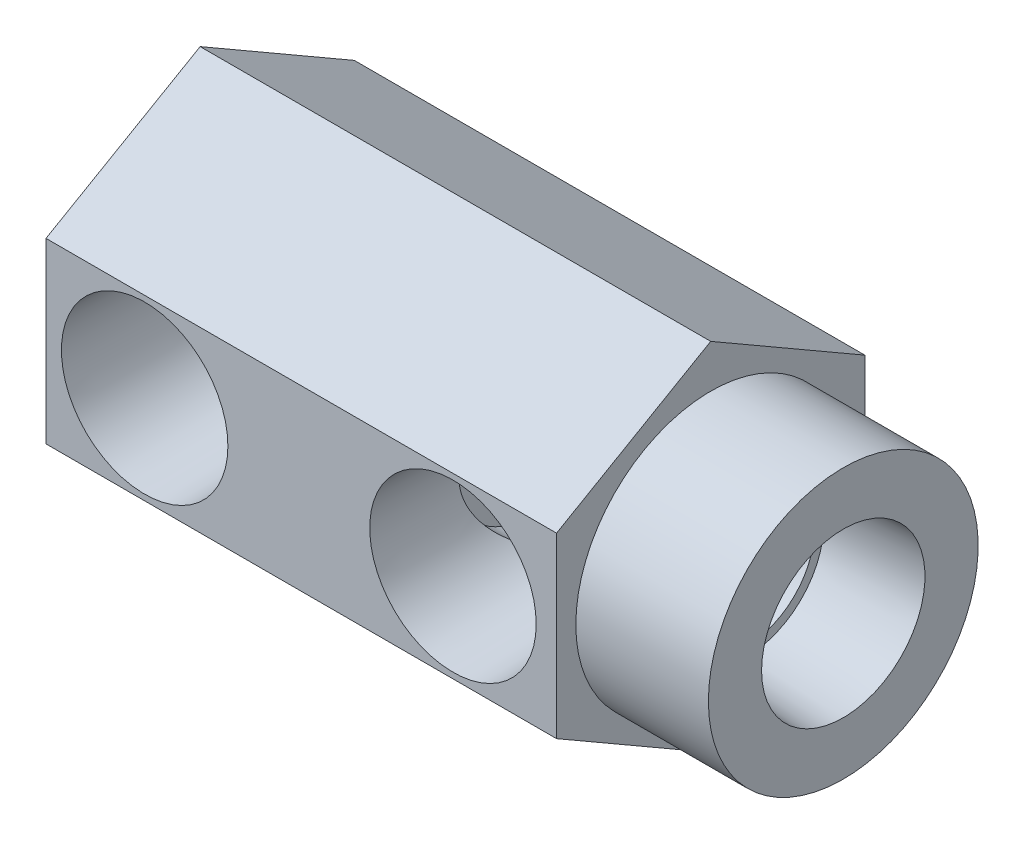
ISO-10303-21;
HEADER;
FILE_DESCRIPTION(('STEP AP214'),'2;1');
FILE_NAME('part.step','',(''),(''),'','','');
FILE_SCHEMA(('AUTOMOTIVE_DESIGN { 1 0 10303 214 1 1 1 1 }'));
ENDSEC;
DATA;
#1=APPLICATION_CONTEXT('core data for automotive mechanical design processes');
#2=APPLICATION_PROTOCOL_DEFINITION('international standard','automotive_design',2000,#1);
#3=PRODUCT_CONTEXT('',#1,'mechanical');
#4=PRODUCT('Part','Part','',(#3));
#5=PRODUCT_RELATED_PRODUCT_CATEGORY('part','',(#4));
#6=PRODUCT_DEFINITION_FORMATION('','',#4);
#7=PRODUCT_DEFINITION_CONTEXT('part definition',#1,'design');
#8=PRODUCT_DEFINITION('design','',#6,#7);
#9=PRODUCT_DEFINITION_SHAPE('','',#8);
#10=(LENGTH_UNIT() NAMED_UNIT(*) SI_UNIT(.MILLI.,.METRE.));
#11=(NAMED_UNIT(*) PLANE_ANGLE_UNIT() SI_UNIT($,.RADIAN.));
#12=(NAMED_UNIT(*) SI_UNIT($,.STERADIAN.) SOLID_ANGLE_UNIT());
#13=UNCERTAINTY_MEASURE_WITH_UNIT(LENGTH_MEASURE(1.E-05),#10,'distance_accuracy_value','');
#14=(GEOMETRIC_REPRESENTATION_CONTEXT(3) GLOBAL_UNCERTAINTY_ASSIGNED_CONTEXT((#13)) GLOBAL_UNIT_ASSIGNED_CONTEXT((#10,
#11,#12)) REPRESENTATION_CONTEXT('',''));
#15=CARTESIAN_POINT('',(0.,0.,0.));
#16=DIRECTION('',(0.,0.,1.));
#17=DIRECTION('',(1.,0.,0.));
#18=AXIS2_PLACEMENT_3D('',#15,#16,#17);
#19=CARTESIAN_POINT('',(52.9844,0.,0.));
#20=DIRECTION('',(1.,0.,0.));
#21=DIRECTION('',(0.,0.,-1.));
#22=AXIS2_PLACEMENT_3D('',#19,#20,#21);
#23=CYLINDRICAL_SURFACE('',#22,3.17499999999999);
#24=CARTESIAN_POINT('',(21.2344,0.,0.));
#25=DIRECTION('',(1.,0.,0.));
#26=DIRECTION('',(0.,0.,-1.));
#27=AXIS2_PLACEMENT_3D('',#24,#25,#26);
#28=CIRCLE('',#27,3.17499999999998);
#29=CARTESIAN_POINT('',(21.2344,0.,-3.17499999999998));
#30=VERTEX_POINT('',#29);
#31=EDGE_CURVE('E171',#30,#30,#28,.T.);
#32=ORIENTED_EDGE('',*,*,#31,.F.);
#33=EDGE_LOOP('',(#32));
#34=FACE_BOUND('',#33,.T.);
#35=CARTESIAN_POINT('',(26.79065,0.,0.));
#36=DIRECTION('',(1.,0.,0.));
#37=DIRECTION('',(0.,0.,-1.));
#38=AXIS2_PLACEMENT_3D('',#35,#36,#37);
#39=CIRCLE('',#38,3.17499999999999);
#40=CARTESIAN_POINT('',(26.79065,0.,-3.17499999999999));
#41=VERTEX_POINT('',#40);
#42=EDGE_CURVE('E38',#41,#41,#39,.F.);
#43=ORIENTED_EDGE('',*,*,#42,.F.);
#44=EDGE_LOOP('',(#43));
#45=FACE_BOUND('',#44,.T.);
#46=ADVANCED_FACE('F34',(#34,#45),#23,.F.);
#47=CARTESIAN_POINT('',(39.0906,0.,2.6797));
#48=DIRECTION('',(0.,0.,-1.));
#49=DIRECTION('',(-1.,0.,0.));
#50=AXIS2_PLACEMENT_3D('',#47,#48,#49);
#51=PLANE('',#50);
#52=DIRECTION('',(-1.,0.,0.));
#53=VECTOR('',#52,1.);
#54=CARTESIAN_POINT('',(0.,4.86010266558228,2.6797));
#55=LINE('',#54,#53);
#56=CARTESIAN_POINT('',(37.9310089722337,4.86010266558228,2.6797));
#57=VERTEX_POINT('',#56);
#58=CARTESIAN_POINT('',(36.2339048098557,4.86010266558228,2.6797));
#59=VERTEX_POINT('',#58);
#60=EDGE_CURVE('E435',#57,#59,#55,.T.);
#61=ORIENTED_EDGE('',*,*,#60,.F.);
#62=CARTESIAN_POINT('',(33.528,0.,2.6797));
#63=DIRECTION('',(0.,0.,1.));
#64=DIRECTION('',(1.,0.,0.));
#65=AXIS2_PLACEMENT_3D('',#62,#63,#64);
#66=CIRCLE('',#65,6.55797879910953);
#67=CARTESIAN_POINT('',(29.1249910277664,4.86010266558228,2.6797));
#68=VERTEX_POINT('',#67);
#69=EDGE_CURVE('E415',#57,#68,#66,.T.);
#70=ORIENTED_EDGE('',*,*,#69,.T.);
#71=CARTESIAN_POINT('',(30.8220951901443,4.86010266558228,2.6797));
#72=VERTEX_POINT('',#71);
#73=EDGE_CURVE('E276',#72,#68,#55,.T.);
#74=ORIENTED_EDGE('',*,*,#73,.F.);
#75=CARTESIAN_POINT('',(33.528,0.,2.6797));
#76=DIRECTION('',(0.,0.,1.));
#77=DIRECTION('',(1.,0.,0.));
#78=AXIS2_PLACEMENT_3D('',#75,#76,#77);
#79=CIRCLE('',#78,5.5626);
#80=EDGE_CURVE('E163',#59,#72,#79,.T.);
#81=ORIENTED_EDGE('',*,*,#80,.F.);
#82=EDGE_LOOP('',(#61,#70,#74,#81));
#83=FACE_BOUND('',#82,.T.);
#84=ADVANCED_FACE('F258',(#83),#51,.F.);
#85=DIRECTION('',(-1.,0.,0.));
#86=VECTOR('',#85,1.);
#87=CARTESIAN_POINT('',(0.,-4.86010266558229,2.6797));
#88=LINE('',#87,#86);
#89=CARTESIAN_POINT('',(29.1249910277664,-4.86010266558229,2.6797));
#90=VERTEX_POINT('',#89);
#91=CARTESIAN_POINT('',(30.8220951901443,-4.86010266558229,2.6797));
#92=VERTEX_POINT('',#91);
#93=EDGE_CURVE('E164',#90,#92,#88,.F.);
#94=ORIENTED_EDGE('',*,*,#93,.F.);
#95=CARTESIAN_POINT('',(37.9310089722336,-4.86010266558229,2.6797));
#96=VERTEX_POINT('',#95);
#97=EDGE_CURVE('E411',#90,#96,#66,.T.);
#98=ORIENTED_EDGE('',*,*,#97,.T.);
#99=CARTESIAN_POINT('',(36.2339048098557,-4.86010266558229,2.6797));
#100=VERTEX_POINT('',#99);
#101=EDGE_CURVE('E317',#100,#96,#88,.F.);
#102=ORIENTED_EDGE('',*,*,#101,.F.);
#103=EDGE_CURVE('E424',#92,#100,#79,.T.);
#104=ORIENTED_EDGE('',*,*,#103,.F.);
#105=EDGE_LOOP('',(#94,#98,#102,#104));
#106=FACE_BOUND('',#105,.T.);
#107=ADVANCED_FACE('F256',(#106),#51,.F.);
#108=CARTESIAN_POINT('',(33.528,0.,12.7));
#109=DIRECTION('',(0.,0.,1.));
#110=DIRECTION('',(1.,0.,0.));
#111=AXIS2_PLACEMENT_3D('',#108,#109,#110);
#112=CONICAL_SURFACE('',#111,6.858,0.0299323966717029);
#113=CARTESIAN_POINT('',(33.528,0.,12.7));
#114=DIRECTION('',(0.,0.,1.));
#115=DIRECTION('',(1.,0.,0.));
#116=AXIS2_PLACEMENT_3D('',#113,#114,#115);
#117=CIRCLE('',#116,6.858);
#118=CARTESIAN_POINT('',(40.386,0.,12.7));
#119=VERTEX_POINT('',#118);
#120=EDGE_CURVE('E410',#119,#119,#117,.T.);
#121=ORIENTED_EDGE('',*,*,#120,.T.);
#122=EDGE_LOOP('',(#121));
#123=FACE_BOUND('',#122,.T.);
#124=CARTESIAN_POINT('',(37.9308783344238,-4.86021293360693,2.6795));
#125=CARTESIAN_POINT('',(37.9796010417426,-4.81909090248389,2.75408000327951));
#126=CARTESIAN_POINT('',(38.0286598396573,-4.77636003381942,2.82753681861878));
#127=CARTESIAN_POINT('',(38.1271327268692,-4.68768621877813,2.97223805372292));
#128=CARTESIAN_POINT('',(38.1765468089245,-4.64174333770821,3.04348251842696));
#129=CARTESIAN_POINT('',(38.3249383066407,-4.4990172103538,3.25407862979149));
#130=CARTESIAN_POINT('',(38.4239764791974,-4.3974102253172,3.39015939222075));
#131=CARTESIAN_POINT('',(38.6208561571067,-4.1803388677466,3.65453950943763));
#132=CARTESIAN_POINT('',(38.7186784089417,-4.06475615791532,3.78275622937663));
#133=CARTESIAN_POINT('',(38.9100637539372,-3.82049762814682,4.029307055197));
#134=CARTESIAN_POINT('',(39.0036289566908,-3.69182839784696,4.14764608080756));
#135=CARTESIAN_POINT('',(39.2343157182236,-3.34676203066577,4.43565665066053));
#136=CARTESIAN_POINT('',(39.3671686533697,-3.12096559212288,4.5978682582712));
#137=CARTESIAN_POINT('',(39.5489763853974,-2.75981236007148,4.81711655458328));
#138=CARTESIAN_POINT('',(39.6066004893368,-2.63586854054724,4.88611027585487));
#139=CARTESIAN_POINT('',(39.7151484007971,-2.38067403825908,5.01539772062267));
#140=CARTESIAN_POINT('',(39.7660734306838,-2.24942469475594,5.07569303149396));
#141=CARTESIAN_POINT('',(39.8520863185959,-2.00333052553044,5.17712379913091));
#142=CARTESIAN_POINT('',(39.8883924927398,-1.88953159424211,5.21977180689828));
#143=CARTESIAN_POINT('',(39.9550956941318,-1.65782803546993,5.29791803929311));
#144=CARTESIAN_POINT('',(39.9854939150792,-1.53992424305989,5.33341770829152));
#145=CARTESIAN_POINT('',(40.0398569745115,-1.30057990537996,5.39677782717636));
#146=CARTESIAN_POINT('',(40.063819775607,-1.17913825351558,5.42463585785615));
#147=CARTESIAN_POINT('',(40.1048268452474,-0.933578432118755,5.47224389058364));
#148=CARTESIAN_POINT('',(40.1218743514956,-0.809461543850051,5.49199768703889));
#149=CARTESIAN_POINT('',(40.1487709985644,-0.55885523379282,5.5231405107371));
#150=CARTESIAN_POINT('',(40.1585888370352,-0.432357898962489,5.53449316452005));
#151=CARTESIAN_POINT('',(40.1706904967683,-0.178520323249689,5.5484842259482));
#152=CARTESIAN_POINT('',(40.172974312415,-0.0511800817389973,5.55112262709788));
#153=CARTESIAN_POINT('',(40.1699567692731,0.203283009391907,5.54763517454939));
#154=CARTESIAN_POINT('',(40.16465579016,0.330405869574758,5.54150975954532));
#155=CARTESIAN_POINT('',(40.1465880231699,0.583395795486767,5.5206114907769));
#156=CARTESIAN_POINT('',(40.1338214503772,0.709262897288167,5.50583888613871));
#157=CARTESIAN_POINT('',(40.1022018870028,0.950343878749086,5.46919361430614));
#158=CARTESIAN_POINT('',(40.0838182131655,1.06570311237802,5.44786787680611));
#159=CARTESIAN_POINT('',(40.0411295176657,1.29381096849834,5.3982490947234));
#160=CARTESIAN_POINT('',(40.0168222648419,1.40655858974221,5.36995342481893));
#161=CARTESIAN_POINT('',(39.9356091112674,1.73984674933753,5.2751807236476));
#162=CARTESIAN_POINT('',(39.8703780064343,1.955681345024,5.19877913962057));
#163=CARTESIAN_POINT('',(39.7466819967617,2.30076549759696,5.05275121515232));
#164=CARTESIAN_POINT('',(39.6933328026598,2.43470156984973,4.98950366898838));
#165=CARTESIAN_POINT('',(39.5797013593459,2.6948493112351,4.85393413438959));
#166=CARTESIAN_POINT('',(39.519417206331,2.821058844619,4.78160965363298));
#167=CARTESIAN_POINT('',(39.3293668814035,3.1883592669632,4.55185021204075));
#168=CARTESIAN_POINT('',(39.1907125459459,3.4172894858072,4.38199026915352));
#169=CARTESIAN_POINT('',(38.9573299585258,3.75614165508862,4.08913434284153));
#170=CARTESIAN_POINT('',(38.8672558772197,3.8769998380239,3.97462339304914));
#171=CARTESIAN_POINT('',(38.6834858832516,4.10679298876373,3.7367067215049));
#172=CARTESIAN_POINT('',(38.5897886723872,4.2157236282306,3.61329779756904));
#173=CARTESIAN_POINT('',(38.4015163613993,4.42068084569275,3.35936882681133));
#174=CARTESIAN_POINT('',(38.3069577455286,4.51681890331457,3.22892636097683));
#175=CARTESIAN_POINT('',(38.1653363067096,4.65221359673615,3.02734860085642));
#176=CARTESIAN_POINT('',(38.1181809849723,4.69586329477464,2.95919413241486));
#177=CARTESIAN_POINT('',(38.024207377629,4.78023530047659,2.82086775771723));
#178=CARTESIAN_POINT('',(37.9773891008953,4.82095753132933,2.75069579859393));
#179=CARTESIAN_POINT('',(37.9308783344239,4.86021293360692,2.6795));
#180=B_SPLINE_CURVE_WITH_KNOTS('',3,(#124,#125,#126,#127,#128,#129,#130,#131,#132,#133,#134,
#135,#136,#137,#138,#139,#140,#141,#142,#143,#144,#145,#146,#147,#148,#149,#150,#151,#152,#153,
#154,#155,#156,#157,#158,#159,#160,#161,#162,#163,#164,#165,#166,#167,#168,#169,#170,#171,#172,
#173,#174,#175,#176,#177,#178,#179),.UNSPECIFIED.,.F.,.F.,(4,2,2,2,2,2,2,2,2,2,2,2,2,2,2,2,2,2,
2,2,2,2,2,2,2,2,2,4),(0.,0.294309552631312,0.588613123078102,1.17774797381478,1.77227581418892,
2.36650575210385,3.28677118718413,3.74565786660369,4.20446069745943,4.58459599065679,
4.96465439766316,5.34483298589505,5.72483337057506,6.10646952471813,6.48810596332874,
6.86972329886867,7.25132964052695,7.60716212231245,7.96312883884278,8.67430841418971,
9.14605597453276,9.61793335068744,10.5645286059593,11.1319225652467,11.6995217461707,
12.2617956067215,12.5427445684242,12.8237008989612),.UNSPECIFIED.);
#181=EDGE_CURVE('E262',#96,#57,#180,.T.);
#182=ORIENTED_EDGE('',*,*,#181,.F.);
#183=ORIENTED_EDGE('',*,*,#97,.F.);
#184=CARTESIAN_POINT('',(29.1251216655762,4.86021293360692,2.6795));
#185=CARTESIAN_POINT('',(29.0763989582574,4.81909090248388,2.75408000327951));
#186=CARTESIAN_POINT('',(29.0273401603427,4.77636003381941,2.82753681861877));
#187=CARTESIAN_POINT('',(28.9288672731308,4.68768621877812,2.97223805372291));
#188=CARTESIAN_POINT('',(28.8794531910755,4.64174333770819,3.04348251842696));
#189=CARTESIAN_POINT('',(28.7310616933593,4.49901721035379,3.25407862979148));
#190=CARTESIAN_POINT('',(28.6320235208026,4.39741022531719,3.39015939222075));
#191=CARTESIAN_POINT('',(28.4351438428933,4.18033886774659,3.65453950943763));
#192=CARTESIAN_POINT('',(28.3373215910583,4.0647561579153,3.78275622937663));
#193=CARTESIAN_POINT('',(28.1459362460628,3.82049762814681,4.029307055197));
#194=CARTESIAN_POINT('',(28.0523710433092,3.69182839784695,4.14764608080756));
#195=CARTESIAN_POINT('',(27.8216842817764,3.34676203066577,4.43565665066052));
#196=CARTESIAN_POINT('',(27.6888313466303,3.12096559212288,4.5978682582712));
#197=CARTESIAN_POINT('',(27.5070236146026,2.75981236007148,4.81711655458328));
#198=CARTESIAN_POINT('',(27.4493995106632,2.63586854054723,4.88611027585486));
#199=CARTESIAN_POINT('',(27.3408515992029,2.38067403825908,5.01539772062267));
#200=CARTESIAN_POINT('',(27.2899265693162,2.24942469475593,5.07569303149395));
#201=CARTESIAN_POINT('',(27.2039136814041,2.00333052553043,5.17712379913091));
#202=CARTESIAN_POINT('',(27.1676075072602,1.8895315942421,5.21977180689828));
#203=CARTESIAN_POINT('',(27.1009043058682,1.65782803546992,5.29791803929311));
#204=CARTESIAN_POINT('',(27.0705060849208,1.53992424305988,5.33341770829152));
#205=CARTESIAN_POINT('',(27.0161430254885,1.30057990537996,5.39677782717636));
#206=CARTESIAN_POINT('',(26.992180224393,1.17913825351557,5.42463585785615));
#207=CARTESIAN_POINT('',(26.9511731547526,0.933578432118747,5.47224389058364));
#208=CARTESIAN_POINT('',(26.9341256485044,0.809461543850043,5.49199768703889));
#209=CARTESIAN_POINT('',(26.9072290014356,0.558855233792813,5.52314051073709));
#210=CARTESIAN_POINT('',(26.8974111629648,0.432357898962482,5.53449316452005));
#211=CARTESIAN_POINT('',(26.8853095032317,0.178520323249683,5.5484842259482));
#212=CARTESIAN_POINT('',(26.883025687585,0.0511800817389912,5.55112262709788));
#213=CARTESIAN_POINT('',(26.8860432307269,-0.203283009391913,5.54763517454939));
#214=CARTESIAN_POINT('',(26.89134420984,-0.330405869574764,5.54150975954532));
#215=CARTESIAN_POINT('',(26.9094119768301,-0.583395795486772,5.5206114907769));
#216=CARTESIAN_POINT('',(26.9221785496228,-0.709262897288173,5.50583888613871));
#217=CARTESIAN_POINT('',(26.9537981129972,-0.950343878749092,5.46919361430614));
#218=CARTESIAN_POINT('',(26.9721817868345,-1.06570311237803,5.44786787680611));
#219=CARTESIAN_POINT('',(27.0148704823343,-1.29381096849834,5.39824909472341));
#220=CARTESIAN_POINT('',(27.0391777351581,-1.40655858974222,5.36995342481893));
#221=CARTESIAN_POINT('',(27.1203908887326,-1.73984674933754,5.2751807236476));
#222=CARTESIAN_POINT('',(27.1856219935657,-1.95568134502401,5.19877913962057));
#223=CARTESIAN_POINT('',(27.3093180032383,-2.30076549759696,5.05275121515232));
#224=CARTESIAN_POINT('',(27.3626671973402,-2.43470156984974,4.98950366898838));
#225=CARTESIAN_POINT('',(27.4762986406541,-2.69484931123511,4.85393413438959));
#226=CARTESIAN_POINT('',(27.536582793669,-2.82105884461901,4.78160965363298));
#227=CARTESIAN_POINT('',(27.7266331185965,-3.18835926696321,4.55185021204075));
#228=CARTESIAN_POINT('',(27.8652874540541,-3.41728948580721,4.38199026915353));
#229=CARTESIAN_POINT('',(28.0986700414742,-3.75614165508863,4.08913434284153));
#230=CARTESIAN_POINT('',(28.1887441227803,-3.87699983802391,3.97462339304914));
#231=CARTESIAN_POINT('',(28.3725141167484,-4.10679298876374,3.7367067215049));
#232=CARTESIAN_POINT('',(28.4662113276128,-4.21572362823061,3.61329779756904));
#233=CARTESIAN_POINT('',(28.6544836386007,-4.42068084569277,3.35936882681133));
#234=CARTESIAN_POINT('',(28.7490422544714,-4.51681890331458,3.22892636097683));
#235=CARTESIAN_POINT('',(28.8906636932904,-4.65221359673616,3.02734860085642));
#236=CARTESIAN_POINT('',(28.9378190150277,-4.69586329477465,2.95919413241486));
#237=CARTESIAN_POINT('',(29.031792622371,-4.7802353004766,2.82086775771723));
#238=CARTESIAN_POINT('',(29.0786108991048,-4.82095753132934,2.75069579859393));
#239=CARTESIAN_POINT('',(29.1251216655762,-4.86021293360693,2.6795));
#240=B_SPLINE_CURVE_WITH_KNOTS('',3,(#184,#185,#186,#187,#188,#189,#190,#191,#192,#193,#194,
#195,#196,#197,#198,#199,#200,#201,#202,#203,#204,#205,#206,#207,#208,#209,#210,#211,#212,#213,
#214,#215,#216,#217,#218,#219,#220,#221,#222,#223,#224,#225,#226,#227,#228,#229,#230,#231,#232,
#233,#234,#235,#236,#237,#238,#239),.UNSPECIFIED.,.F.,.F.,(4,2,2,2,2,2,2,2,2,2,2,2,2,2,2,2,2,2,
2,2,2,2,2,2,2,2,2,4),(0.,0.294309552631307,0.588613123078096,1.17774797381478,1.77227581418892,
2.36650575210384,3.28677118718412,3.74565786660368,4.20446069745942,4.58459599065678,
4.96465439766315,5.34483298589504,5.72483337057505,6.10646952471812,6.48810596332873,
6.86972329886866,7.25132964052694,7.60716212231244,7.96312883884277,8.6743084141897,
9.14605597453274,9.61793335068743,10.5645286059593,11.1319225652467,11.6995217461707,
12.2617956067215,12.5427445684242,12.8237008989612),.UNSPECIFIED.);
#241=EDGE_CURVE('E270',#68,#90,#240,.T.);
#242=ORIENTED_EDGE('',*,*,#241,.F.);
#243=ORIENTED_EDGE('',*,*,#69,.F.);
#244=EDGE_LOOP('',(#182,#183,#242,#243));
#245=FACE_BOUND('',#244,.T.);
#246=ADVANCED_FACE('F252',(#123,#245),#112,.F.);
#247=CARTESIAN_POINT('',(33.528,0.,12.7));
#248=DIRECTION('',(0.,0.,1.));
#249=DIRECTION('',(1.,0.,0.));
#250=AXIS2_PLACEMENT_3D('',#247,#248,#249);
#251=CYLINDRICAL_SURFACE('',#250,5.56260000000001);
#252=CARTESIAN_POINT('',(29.1430778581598,3.42271479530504,-4.3688));
#253=CARTESIAN_POINT('',(29.2053786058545,3.50252392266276,-4.30626922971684));
#254=CARTESIAN_POINT('',(29.2692305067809,3.57983993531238,-4.24217199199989));
#255=CARTESIAN_POINT('',(29.3997001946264,3.72954742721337,-4.111175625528));
#256=CARTESIAN_POINT('',(29.4663169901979,3.80194064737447,-4.0442775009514));
#257=CARTESIAN_POINT('',(29.6696020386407,4.01162562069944,-3.84008739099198));
#258=CARTESIAN_POINT('',(29.8099614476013,4.14174719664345,-3.69904228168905));
#259=CARTESIAN_POINT('',(30.0975597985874,4.38288342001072,-3.40984184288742));
#260=CARTESIAN_POINT('',(30.2447640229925,4.4939834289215,-3.26172230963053));
#261=CARTESIAN_POINT('',(30.5450099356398,4.69864874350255,-2.95929639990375));
#262=CARTESIAN_POINT('',(30.6980539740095,4.79220689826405,-2.80498753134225));
#263=CARTESIAN_POINT('',(30.9831508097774,4.94855700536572,-2.51703491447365));
#264=CARTESIAN_POINT('',(31.1145644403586,5.01387804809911,-2.38411695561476));
#265=CARTESIAN_POINT('',(31.3796036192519,5.13303105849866,-2.11541586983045));
#266=CARTESIAN_POINT('',(31.5132288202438,5.1868648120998,-1.97963319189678));
#267=CARTESIAN_POINT('',(31.7816711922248,5.28329287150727,-1.7056562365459));
#268=CARTESIAN_POINT('',(31.9164866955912,5.32590091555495,-1.56746512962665));
#269=CARTESIAN_POINT('',(32.1863893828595,5.40019502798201,-1.28848056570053));
#270=CARTESIAN_POINT('',(32.3214764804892,5.43188413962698,-1.14768784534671));
#271=CARTESIAN_POINT('',(32.5189904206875,5.47070908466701,-0.936746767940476));
#272=CARTESIAN_POINT('',(32.5823943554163,5.48200911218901,-0.868244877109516));
#273=CARTESIAN_POINT('',(32.7080219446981,5.50219723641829,-0.729494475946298));
#274=CARTESIAN_POINT('',(32.7702429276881,5.51108036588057,-0.659242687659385));
#275=CARTESIAN_POINT('',(32.878517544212,5.5247658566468,-0.530668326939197));
#276=CARTESIAN_POINT('',(32.9252277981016,5.53003323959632,-0.4729291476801));
#277=CARTESIAN_POINT('',(33.0138391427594,5.53895660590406,-0.353523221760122));
#278=CARTESIAN_POINT('',(33.0557550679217,5.54261766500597,-0.291869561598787));
#279=CARTESIAN_POINT('',(33.1029068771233,5.54635110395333,-0.200071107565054));
#280=CARTESIAN_POINT('',(33.1149282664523,5.54725075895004,-0.17362424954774));
#281=CARTESIAN_POINT('',(33.1346806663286,5.54868581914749,-0.11920938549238));
#282=CARTESIAN_POINT('',(33.1424339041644,5.54922311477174,-0.091250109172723));
#283=CARTESIAN_POINT('',(33.1507682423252,5.54979551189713,-0.0406082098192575));
#284=CARTESIAN_POINT('',(33.1525611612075,5.54991574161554,-0.0181354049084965));
#285=CARTESIAN_POINT('',(33.1520473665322,5.5498809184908,0.0267461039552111));
#286=CARTESIAN_POINT('',(33.1497432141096,5.54972603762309,0.0491548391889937));
#287=CARTESIAN_POINT('',(33.1402182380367,5.54906942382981,0.100345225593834));
#288=CARTESIAN_POINT('',(33.1316568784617,5.54847233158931,0.128864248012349));
#289=CARTESIAN_POINT('',(33.1103226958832,5.54690714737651,0.184367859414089));
#290=CARTESIAN_POINT('',(33.0975213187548,5.54593653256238,0.21134054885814));
#291=CARTESIAN_POINT('',(33.0586644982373,5.54281975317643,0.284099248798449));
#292=CARTESIAN_POINT('',(33.0299816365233,5.5403433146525,0.328420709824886));
#293=CARTESIAN_POINT('',(32.9692649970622,5.5345538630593,0.414689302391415));
#294=CARTESIAN_POINT('',(32.9372207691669,5.53123819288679,0.456628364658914));
#295=CARTESIAN_POINT('',(32.8710999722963,5.52377748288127,0.539458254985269));
#296=CARTESIAN_POINT('',(32.8370069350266,5.51962483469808,0.580335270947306));
#297=CARTESIAN_POINT('',(32.7679056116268,5.51053473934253,0.661091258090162));
#298=CARTESIAN_POINT('',(32.7328988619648,5.50559854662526,0.700971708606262));
#299=CARTESIAN_POINT('',(32.6194514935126,5.48846855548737,0.828218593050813));
#300=CARTESIAN_POINT('',(32.5399173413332,5.47474378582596,0.914407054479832));
#301=CARTESIAN_POINT('',(32.3799423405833,5.44345110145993,1.08523802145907));
#302=CARTESIAN_POINT('',(32.2995012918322,5.42588232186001,1.16988017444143));
#303=CARTESIAN_POINT('',(32.0576616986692,5.36731988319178,1.4223942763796));
#304=CARTESIAN_POINT('',(31.8959389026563,5.32049832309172,1.58864694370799));
#305=CARTESIAN_POINT('',(31.5803741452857,5.21306486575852,1.91130379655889));
#306=CARTESIAN_POINT('',(31.4264669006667,5.15304719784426,2.06784173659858));
#307=CARTESIAN_POINT('',(31.1978738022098,5.05172859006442,2.29968019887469));
#308=CARTESIAN_POINT('',(31.1221017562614,5.01610006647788,2.37641685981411));
#309=CARTESIAN_POINT('',(30.9714170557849,4.94100069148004,2.52885627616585));
#310=CARTESIAN_POINT('',(30.89650445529,4.90152959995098,2.60455896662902));
#311=CARTESIAN_POINT('',(30.8220951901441,4.8601026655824,2.67969999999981));
#312=B_SPLINE_CURVE_WITH_KNOTS('',3,(#252,#253,#254,#255,#256,#257,#258,#259,#260,#261,#262,
#263,#264,#265,#266,#267,#268,#269,#270,#271,#272,#273,#274,#275,#276,#277,#278,#279,#280,#281,
#282,#283,#284,#285,#286,#287,#288,#289,#290,#291,#292,#293,#294,#295,#296,#297,#298,#299,#300,
#301,#302,#303,#304,#305,#306,#307,#308,#309,#310,#311),.UNSPECIFIED.,.F.,.F.,(4,2,2,2,2,2,2,2,
2,2,2,2,2,2,2,2,2,2,2,2,2,2,2,2,2,2,2,2,2,4),(0.,0.356890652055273,0.713654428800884,
1.42572741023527,2.13451598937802,2.84359287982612,3.4372250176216,4.03076479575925,
4.6235747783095,5.2162194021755,5.49827347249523,5.78090291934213,6.00433449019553,
6.22705487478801,6.3140330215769,6.40055381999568,6.46782718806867,6.53505851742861,
6.62386536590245,6.71328286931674,6.87138898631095,7.03000208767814,7.19012792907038,
7.34999994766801,7.70411945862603,8.05831872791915,8.7675669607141,9.44975807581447,
9.7904185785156,10.1311003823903),.UNSPECIFIED.);
#313=CARTESIAN_POINT('',(29.1430778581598,3.42271479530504,-4.3688));
#314=VERTEX_POINT('',#313);
#315=EDGE_CURVE('E149',#314,#72,#312,.T.);
#316=ORIENTED_EDGE('',*,*,#315,.F.);
#317=CARTESIAN_POINT('',(33.528,0.,-4.3688));
#318=DIRECTION('',(0.,0.,1.));
#319=DIRECTION('',(1.,0.,0.));
#320=AXIS2_PLACEMENT_3D('',#317,#318,#319);
#321=CIRCLE('',#320,5.56260000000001);
#322=CARTESIAN_POINT('',(37.9129221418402,3.42271479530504,-4.3688));
#323=VERTEX_POINT('',#322);
#324=EDGE_CURVE('E161',#323,#314,#321,.T.);
#325=ORIENTED_EDGE('',*,*,#324,.F.);
#326=CARTESIAN_POINT('',(36.2339048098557,4.86010266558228,2.6797));
#327=CARTESIAN_POINT('',(36.1573626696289,4.90271691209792,2.6024048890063));
#328=CARTESIAN_POINT('',(36.0802883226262,4.94326160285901,2.52451611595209));
#329=CARTESIAN_POINT('',(35.9252343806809,5.02028696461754,2.36764700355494));
#330=CARTESIAN_POINT('',(35.8472548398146,5.05676787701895,2.28866672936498));
#331=CARTESIAN_POINT('',(35.6120714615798,5.16028405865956,2.05010484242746));
#332=CARTESIAN_POINT('',(35.4537326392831,5.22133212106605,1.88901283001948));
#333=CARTESIAN_POINT('',(35.1345730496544,5.32821249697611,1.56246076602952));
#334=CARTESIAN_POINT('',(34.9737434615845,5.37396013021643,1.39698170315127));
#335=CARTESIAN_POINT('',(34.7333316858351,5.43106765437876,1.14553430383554));
#336=CARTESIAN_POINT('',(34.6533574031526,5.44818105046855,1.06120651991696));
#337=CARTESIAN_POINT('',(34.4943992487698,5.47860389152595,0.890954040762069));
#338=CARTESIAN_POINT('',(34.4154151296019,5.49191430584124,0.805029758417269));
#339=CARTESIAN_POINT('',(34.2931936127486,5.50990529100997,0.667021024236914));
#340=CARTESIAN_POINT('',(34.2489571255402,5.51585557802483,0.615983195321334));
#341=CARTESIAN_POINT('',(34.1624383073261,5.52647109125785,0.512104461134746));
#342=CARTESIAN_POINT('',(34.1201555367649,5.5311366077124,0.459263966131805));
#343=CARTESIAN_POINT('',(34.0564332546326,5.53749527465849,0.372271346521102));
#344=CARTESIAN_POINT('',(34.033506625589,5.53962582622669,0.339251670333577));
#345=CARTESIAN_POINT('',(33.9905937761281,5.54337271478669,0.271242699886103));
#346=CARTESIAN_POINT('',(33.9706061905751,5.54498929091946,0.236254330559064));
#347=CARTESIAN_POINT('',(33.9426831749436,5.54713245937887,0.176754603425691));
#348=CARTESIAN_POINT('',(33.933013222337,5.54784146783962,0.153090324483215));
#349=CARTESIAN_POINT('',(33.9172951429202,5.54896659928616,0.104612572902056));
#350=CARTESIAN_POINT('',(33.9112335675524,5.54938381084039,0.0798037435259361));
#351=CARTESIAN_POINT('',(33.9039509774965,5.54988255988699,0.029035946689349));
#352=CARTESIAN_POINT('',(33.9028053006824,5.54995887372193,0.00306520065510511));
#353=CARTESIAN_POINT('',(33.9059120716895,5.54974795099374,-0.0485454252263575));
#354=CARTESIAN_POINT('',(33.9101699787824,5.54946034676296,-0.0741849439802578));
#355=CARTESIAN_POINT('',(33.9247955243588,5.54843534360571,-0.131549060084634));
#356=CARTESIAN_POINT('',(33.9365743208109,5.54759189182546,-0.162888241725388));
#357=CARTESIAN_POINT('',(33.9643836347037,5.54547446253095,-0.223685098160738));
#358=CARTESIAN_POINT('',(33.9804398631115,5.54419786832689,-0.25313001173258));
#359=CARTESIAN_POINT('',(34.0343579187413,5.53962508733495,-0.343123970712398));
#360=CARTESIAN_POINT('',(34.0763107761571,5.5356796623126,-0.40110731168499));
#361=CARTESIAN_POINT('',(34.1638595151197,5.52631907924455,-0.51417606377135));
#362=CARTESIAN_POINT('',(34.2094670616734,5.52089907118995,-0.569251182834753));
#363=CARTESIAN_POINT('',(34.3026304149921,5.50860024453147,-0.678027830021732));
#364=CARTESIAN_POINT('',(34.350194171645,5.50171487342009,-0.731721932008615));
#365=CARTESIAN_POINT('',(34.4461025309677,5.48652622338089,-0.838028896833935));
#366=CARTESIAN_POINT('',(34.4944457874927,5.47822519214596,-0.890643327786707));
#367=CARTESIAN_POINT('',(34.6402922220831,5.45115530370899,-1.04766823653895));
#368=CARTESIAN_POINT('',(34.7384665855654,5.43023844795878,-1.15109678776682));
#369=CARTESIAN_POINT('',(34.9351156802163,5.38263989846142,-1.35633654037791));
#370=CARTESIAN_POINT('',(35.033590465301,5.35595710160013,-1.45814742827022));
#371=CARTESIAN_POINT('',(35.3287530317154,5.26707075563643,-1.76179770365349));
#372=CARTESIAN_POINT('',(35.5249600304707,5.19606887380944,-1.96162494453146));
#373=CARTESIAN_POINT('',(35.9119743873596,5.03024468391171,-2.35440015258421));
#374=CARTESIAN_POINT('',(36.1028039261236,4.93554387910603,-2.54737764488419));
#375=CARTESIAN_POINT('',(36.4776329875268,4.72109486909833,-2.92572825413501));
#376=CARTESIAN_POINT('',(36.6616385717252,4.60136955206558,-3.11110813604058));
#377=CARTESIAN_POINT('',(36.9369676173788,4.39724605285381,-3.38822135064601));
#378=CARTESIAN_POINT('',(37.0317095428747,4.3222036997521,-3.48352487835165));
#379=CARTESIAN_POINT('',(37.2179314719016,4.1643506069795,-3.67077145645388));
#380=CARTESIAN_POINT('',(37.3094126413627,4.08154268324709,-3.76271570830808));
#381=CARTESIAN_POINT('',(37.488908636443,3.90760849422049,-3.94306288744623));
#382=CARTESIAN_POINT('',(37.5769089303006,3.81645174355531,-4.03145099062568));
#383=CARTESIAN_POINT('',(37.748455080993,3.62583915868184,-4.20370936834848));
#384=CARTESIAN_POINT('',(37.8319969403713,3.52637607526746,-4.28757558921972));
#385=CARTESIAN_POINT('',(37.9129221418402,3.42271479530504,-4.3688));
#386=B_SPLINE_CURVE_WITH_KNOTS('',3,(#326,#327,#328,#329,#330,#331,#332,#333,#334,#335,#336,
#337,#338,#339,#340,#341,#342,#343,#344,#345,#346,#347,#348,#349,#350,#351,#352,#353,#354,#355,
#356,#357,#358,#359,#360,#361,#362,#363,#364,#365,#366,#367,#368,#369,#370,#371,#372,#373,#374,
#375,#376,#377,#378,#379,#380,#381,#382,#383,#384,#385),.UNSPECIFIED.,.F.,.F.,(4,2,2,2,2,2,2,2,
2,2,2,2,2,2,2,2,2,2,2,2,2,2,2,2,2,2,2,2,2,4),(0.,0.350444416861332,0.700868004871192,
1.4022157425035,2.10738322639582,2.45975259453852,2.8120320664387,3.01541959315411,
3.21876113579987,3.33946287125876,3.46010836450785,3.53663938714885,3.61288336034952,
3.69029171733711,3.7677783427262,3.8676813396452,3.9681989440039,4.18262718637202,
4.39776940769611,4.61389466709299,4.82967991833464,5.26190889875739,5.69422064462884,
6.55980087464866,7.42103111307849,8.28147706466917,8.74300288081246,9.20436198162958,
9.66747853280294,10.1310035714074),.UNSPECIFIED.);
#387=EDGE_CURVE('E57',#59,#323,#386,.T.);
#388=ORIENTED_EDGE('',*,*,#387,.F.);
#389=ORIENTED_EDGE('',*,*,#80,.T.);
#390=EDGE_LOOP('',(#316,#325,#388,#389));
#391=FACE_BOUND('',#390,.T.);
#392=ADVANCED_FACE('F160',(#391),#251,.F.);
#393=CARTESIAN_POINT('',(37.9129221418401,-3.42271479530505,-4.3688));
#394=CARTESIAN_POINT('',(37.8506213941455,-3.50252392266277,-4.30626922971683));
#395=CARTESIAN_POINT('',(37.7867694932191,-3.57983993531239,-4.24217199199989));
#396=CARTESIAN_POINT('',(37.6562998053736,-3.72954742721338,-4.111175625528));
#397=CARTESIAN_POINT('',(37.5896830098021,-3.80194064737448,-4.0442775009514));
#398=CARTESIAN_POINT('',(37.3863979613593,-4.01162562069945,-3.84008739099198));
#399=CARTESIAN_POINT('',(37.2460385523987,-4.14174719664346,-3.69904228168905));
#400=CARTESIAN_POINT('',(36.9584402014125,-4.38288342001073,-3.40984184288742));
#401=CARTESIAN_POINT('',(36.8112359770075,-4.49398342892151,-3.26172230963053));
#402=CARTESIAN_POINT('',(36.5109900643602,-4.69864874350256,-2.95929639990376));
#403=CARTESIAN_POINT('',(36.3579460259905,-4.79220689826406,-2.80498753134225));
#404=CARTESIAN_POINT('',(36.0728491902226,-4.94855700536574,-2.51703491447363));
#405=CARTESIAN_POINT('',(35.9414355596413,-5.01387804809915,-2.38411695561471));
#406=CARTESIAN_POINT('',(35.676396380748,-5.13303105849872,-2.11541586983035));
#407=CARTESIAN_POINT('',(35.5427711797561,-5.18686481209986,-1.97963319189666));
#408=CARTESIAN_POINT('',(35.274328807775,-5.28329287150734,-1.70565623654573));
#409=CARTESIAN_POINT('',(35.1395133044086,-5.32590091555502,-1.56746512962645));
#410=CARTESIAN_POINT('',(34.8696106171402,-5.40019502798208,-1.28848056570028));
#411=CARTESIAN_POINT('',(34.7345235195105,-5.43188413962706,-1.14768784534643));
#412=CARTESIAN_POINT('',(34.5370095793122,-5.47070908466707,-0.936746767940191));
#413=CARTESIAN_POINT('',(34.4736056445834,-5.48200911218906,-0.868244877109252));
#414=CARTESIAN_POINT('',(34.3479780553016,-5.50219723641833,-0.729494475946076));
#415=CARTESIAN_POINT('',(34.2857570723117,-5.51108036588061,-0.659242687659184));
#416=CARTESIAN_POINT('',(34.1774824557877,-5.52476585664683,-0.530668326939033));
#417=CARTESIAN_POINT('',(34.1307722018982,-5.53003323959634,-0.472929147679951));
#418=CARTESIAN_POINT('',(34.0421608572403,-5.53895660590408,-0.353523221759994));
#419=CARTESIAN_POINT('',(34.0002449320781,-5.54261766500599,-0.291869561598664));
#420=CARTESIAN_POINT('',(33.9530931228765,-5.54635110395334,-0.200071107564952));
#421=CARTESIAN_POINT('',(33.9410717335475,-5.54725075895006,-0.173624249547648));
#422=CARTESIAN_POINT('',(33.9213193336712,-5.5486858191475,-0.119209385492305));
#423=CARTESIAN_POINT('',(33.9135660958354,-5.54922311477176,-0.0912501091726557));
#424=CARTESIAN_POINT('',(33.9052317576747,-5.54979551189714,-0.040608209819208));
#425=CARTESIAN_POINT('',(33.9034388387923,-5.54991574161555,-0.0181354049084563));
#426=CARTESIAN_POINT('',(33.9039526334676,-5.54988091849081,0.0267461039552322));
#427=CARTESIAN_POINT('',(33.9062567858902,-5.5497260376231,0.049154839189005));
#428=CARTESIAN_POINT('',(33.9157817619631,-5.54906942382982,0.100345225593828));
#429=CARTESIAN_POINT('',(33.9243431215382,-5.54847233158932,0.128864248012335));
#430=CARTESIAN_POINT('',(33.9456773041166,-5.54690714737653,0.184367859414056));
#431=CARTESIAN_POINT('',(33.9584786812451,-5.54593653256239,0.211340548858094));
#432=CARTESIAN_POINT('',(33.9973355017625,-5.54281975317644,0.284099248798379));
#433=CARTESIAN_POINT('',(34.0260183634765,-5.54034331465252,0.328420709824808));
#434=CARTESIAN_POINT('',(34.0867350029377,-5.53455386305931,0.414689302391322));
#435=CARTESIAN_POINT('',(34.1187792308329,-5.53123819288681,0.456628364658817));
#436=CARTESIAN_POINT('',(34.1849000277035,-5.5237774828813,0.539458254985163));
#437=CARTESIAN_POINT('',(34.2189930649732,-5.5196248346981,0.580335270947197));
#438=CARTESIAN_POINT('',(34.288094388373,-5.51053473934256,0.66109125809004));
#439=CARTESIAN_POINT('',(34.323101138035,-5.50559854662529,0.700971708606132));
#440=CARTESIAN_POINT('',(34.4365485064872,-5.4884685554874,0.828218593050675));
#441=CARTESIAN_POINT('',(34.5160826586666,-5.474743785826,0.914407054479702));
#442=CARTESIAN_POINT('',(34.6760576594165,-5.44345110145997,1.08523802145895));
#443=CARTESIAN_POINT('',(34.7564987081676,-5.42588232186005,1.16988017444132));
#444=CARTESIAN_POINT('',(34.9983383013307,-5.36731988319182,1.4223942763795));
#445=CARTESIAN_POINT('',(35.1600610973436,-5.32049832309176,1.58864694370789));
#446=CARTESIAN_POINT('',(35.4756258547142,-5.21306486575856,1.91130379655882));
#447=CARTESIAN_POINT('',(35.6295330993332,-5.1530471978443,2.06784173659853));
#448=CARTESIAN_POINT('',(35.8581261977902,-5.05172859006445,2.29968019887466));
#449=CARTESIAN_POINT('',(35.9338982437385,-5.0161000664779,2.37641685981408));
#450=CARTESIAN_POINT('',(36.084582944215,-4.94100069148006,2.52885627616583));
#451=CARTESIAN_POINT('',(36.1594955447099,-4.901529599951,2.60455896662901));
#452=CARTESIAN_POINT('',(36.2339048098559,-4.86010266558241,2.67969999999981));
#453=B_SPLINE_CURVE_WITH_KNOTS('',3,(#393,#394,#395,#396,#397,#398,#399,#400,#401,#402,#403,
#404,#405,#406,#407,#408,#409,#410,#411,#412,#413,#414,#415,#416,#417,#418,#419,#420,#421,#422,
#423,#424,#425,#426,#427,#428,#429,#430,#431,#432,#433,#434,#435,#436,#437,#438,#439,#440,#441,
#442,#443,#444,#445,#446,#447,#448,#449,#450,#451,#452),.UNSPECIFIED.,.F.,.F.,(4,2,2,2,2,2,2,2,
2,2,2,2,2,2,2,2,2,2,2,2,2,2,2,2,2,2,2,2,2,4),(0.,0.356890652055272,0.713654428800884,
1.42572741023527,2.13451598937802,2.84359287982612,3.43722501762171,4.03076479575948,
4.62357477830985,5.21621940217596,5.49827347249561,5.78090291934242,6.00433449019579,
6.22705487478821,6.31403302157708,6.40055381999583,6.4678271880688,6.53505851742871,
6.62386536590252,6.71328286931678,6.87138898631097,7.03000208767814,7.19012792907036,
7.34999994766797,7.70411945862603,8.05831872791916,8.76756696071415,9.44975807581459,
9.79041857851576,10.1311003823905),.UNSPECIFIED.);
#454=CARTESIAN_POINT('',(37.9129221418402,-3.42271479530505,-4.3688));
#455=VERTEX_POINT('',#454);
#456=EDGE_CURVE('E313',#455,#100,#453,.T.);
#457=ORIENTED_EDGE('',*,*,#456,.F.);
#458=CARTESIAN_POINT('',(29.1430778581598,-3.42271479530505,-4.3688));
#459=VERTEX_POINT('',#458);
#460=EDGE_CURVE('E168',#459,#455,#321,.T.);
#461=ORIENTED_EDGE('',*,*,#460,.F.);
#462=CARTESIAN_POINT('',(30.8220951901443,-4.86010266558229,2.6797));
#463=CARTESIAN_POINT('',(30.8986373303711,-4.90271691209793,2.6024048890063));
#464=CARTESIAN_POINT('',(30.9757116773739,-4.94326160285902,2.52451611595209));
#465=CARTESIAN_POINT('',(31.1307656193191,-5.02028696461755,2.36764700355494));
#466=CARTESIAN_POINT('',(31.2087451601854,-5.05676787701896,2.28866672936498));
#467=CARTESIAN_POINT('',(31.4439285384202,-5.16028405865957,2.05010484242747));
#468=CARTESIAN_POINT('',(31.6022673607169,-5.22133212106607,1.88901283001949));
#469=CARTESIAN_POINT('',(31.9214269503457,-5.32821249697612,1.56246076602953));
#470=CARTESIAN_POINT('',(32.0822565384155,-5.37396013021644,1.39698170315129));
#471=CARTESIAN_POINT('',(32.3226683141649,-5.43106765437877,1.14553430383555));
#472=CARTESIAN_POINT('',(32.4026425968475,-5.44818105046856,1.06120651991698));
#473=CARTESIAN_POINT('',(32.5616007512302,-5.47860389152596,0.890954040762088));
#474=CARTESIAN_POINT('',(32.6405848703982,-5.49191430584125,0.805029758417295));
#475=CARTESIAN_POINT('',(32.7628063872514,-5.50990529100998,0.667021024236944));
#476=CARTESIAN_POINT('',(32.8070428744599,-5.51585557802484,0.615983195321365));
#477=CARTESIAN_POINT('',(32.8935616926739,-5.52647109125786,0.512104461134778));
#478=CARTESIAN_POINT('',(32.9358444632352,-5.53113660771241,0.459263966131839));
#479=CARTESIAN_POINT('',(32.9995667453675,-5.53749527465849,0.372271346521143));
#480=CARTESIAN_POINT('',(33.0224933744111,-5.5396258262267,0.339251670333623));
#481=CARTESIAN_POINT('',(33.065406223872,-5.5433727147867,0.271242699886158));
#482=CARTESIAN_POINT('',(33.085393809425,-5.54498929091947,0.236254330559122));
#483=CARTESIAN_POINT('',(33.1133168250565,-5.54713245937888,0.176754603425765));
#484=CARTESIAN_POINT('',(33.1229867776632,-5.54784146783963,0.153090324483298));
#485=CARTESIAN_POINT('',(33.1387048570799,-5.54896659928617,0.104612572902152));
#486=CARTESIAN_POINT('',(33.1447664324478,-5.54938381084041,0.0798037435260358));
#487=CARTESIAN_POINT('',(33.1520490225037,-5.549882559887,0.0290359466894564));
#488=CARTESIAN_POINT('',(33.1531946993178,-5.54995887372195,0.00306520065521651));
#489=CARTESIAN_POINT('',(33.1500879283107,-5.54974795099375,-0.0485454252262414));
#490=CARTESIAN_POINT('',(33.1458300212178,-5.54946034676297,-0.0741849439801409));
#491=CARTESIAN_POINT('',(33.1312044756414,-5.54843534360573,-0.13154906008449));
#492=CARTESIAN_POINT('',(33.1194256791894,-5.54759189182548,-0.162888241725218));
#493=CARTESIAN_POINT('',(33.0916163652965,-5.54547446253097,-0.223685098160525));
#494=CARTESIAN_POINT('',(33.0755601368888,-5.54419786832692,-0.253130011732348));
#495=CARTESIAN_POINT('',(33.0216420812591,-5.53962508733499,-0.343123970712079));
#496=CARTESIAN_POINT('',(32.9796892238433,-5.53567966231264,-0.401107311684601));
#497=CARTESIAN_POINT('',(32.8921404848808,-5.52631907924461,-0.514176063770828));
#498=CARTESIAN_POINT('',(32.8465329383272,-5.52089907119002,-0.569251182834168));
#499=CARTESIAN_POINT('',(32.7533695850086,-5.50860024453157,-0.678027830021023));
#500=CARTESIAN_POINT('',(32.7058058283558,-5.50171487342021,-0.731721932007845));
#501=CARTESIAN_POINT('',(32.6098974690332,-5.48652622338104,-0.838028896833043));
#502=CARTESIAN_POINT('',(32.5615542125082,-5.47822519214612,-0.890643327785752));
#503=CARTESIAN_POINT('',(32.4157077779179,-5.4511553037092,-1.04766823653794));
#504=CARTESIAN_POINT('',(32.3175334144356,-5.430238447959,-1.15109678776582));
#505=CARTESIAN_POINT('',(32.1208843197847,-5.38263989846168,-1.35633654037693));
#506=CARTESIAN_POINT('',(32.0224095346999,-5.35595710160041,-1.45814742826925));
#507=CARTESIAN_POINT('',(31.7272469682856,-5.26707075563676,-1.76179770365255));
#508=CARTESIAN_POINT('',(31.5310399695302,-5.1960688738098,-1.96162494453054));
#509=CARTESIAN_POINT('',(31.1440256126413,-5.03024468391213,-2.35440015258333));
#510=CARTESIAN_POINT('',(30.9531960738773,-4.93554387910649,-2.54737764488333));
#511=CARTESIAN_POINT('',(30.578367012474,-4.72109486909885,-2.92572825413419));
#512=CARTESIAN_POINT('',(30.3943614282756,-4.60136955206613,-3.11110813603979));
#513=CARTESIAN_POINT('',(30.1190323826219,-4.39724605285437,-3.38822135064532));
#514=CARTESIAN_POINT('',(30.024290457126,-4.32220369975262,-3.48352487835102));
#515=CARTESIAN_POINT('',(29.838068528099,-4.16435060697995,-3.67077145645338));
#516=CARTESIAN_POINT('',(29.7465873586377,-4.0815426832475,-3.76271570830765));
#517=CARTESIAN_POINT('',(29.5670913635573,-3.9076084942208,-3.94306288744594));
#518=CARTESIAN_POINT('',(29.4790910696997,-3.81645174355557,-4.03145099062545));
#519=CARTESIAN_POINT('',(29.3075449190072,-3.62583915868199,-4.20370936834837));
#520=CARTESIAN_POINT('',(29.2240030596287,-3.52637607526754,-4.28757558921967));
#521=CARTESIAN_POINT('',(29.1430778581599,-3.42271479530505,-4.3688));
#522=B_SPLINE_CURVE_WITH_KNOTS('',3,(#462,#463,#464,#465,#466,#467,#468,#469,#470,#471,#472,
#473,#474,#475,#476,#477,#478,#479,#480,#481,#482,#483,#484,#485,#486,#487,#488,#489,#490,#491,
#492,#493,#494,#495,#496,#497,#498,#499,#500,#501,#502,#503,#504,#505,#506,#507,#508,#509,#510,
#511,#512,#513,#514,#515,#516,#517,#518,#519,#520,#521),.UNSPECIFIED.,.F.,.F.,(4,2,2,2,2,2,2,2,
2,2,2,2,2,2,2,2,2,2,2,2,2,2,2,2,2,2,2,2,2,4),(0.,0.350444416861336,0.700868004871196,
1.4022157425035,2.10738322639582,2.45975259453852,2.8120320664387,3.01541959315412,
3.21876113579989,3.33946287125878,3.46010836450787,3.53663938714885,3.61288336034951,
3.69029171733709,3.76777834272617,3.86768133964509,3.96819894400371,4.18262718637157,
4.3977694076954,4.61389466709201,4.8296799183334,5.26190889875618,5.69422064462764,
6.55980087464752,7.42103111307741,8.28147706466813,8.74300288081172,9.20436198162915,
9.66747853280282,10.1310035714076),.UNSPECIFIED.);
#523=EDGE_CURVE('E50',#92,#459,#522,.T.);
#524=ORIENTED_EDGE('',*,*,#523,.F.);
#525=ORIENTED_EDGE('',*,*,#103,.T.);
#526=EDGE_LOOP('',(#457,#461,#524,#525));
#527=FACE_BOUND('',#526,.T.);
#528=ADVANCED_FACE('F320',(#527),#251,.F.);
#529=CARTESIAN_POINT('',(33.528,0.,-4.3688));
#530=DIRECTION('',(0.,0.,1.));
#531=DIRECTION('',(1.,0.,0.));
#532=AXIS2_PLACEMENT_3D('',#529,#530,#531);
#533=CONICAL_SURFACE('',#532,5.56260000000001,1.02974425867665);
#534=CARTESIAN_POINT('',(33.528,0.,-7.71114727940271));
#535=VERTEX_POINT('',#534);
#536=VERTEX_LOOP('',#535);
#537=FACE_BOUND('',#536,.T.);
#538=CARTESIAN_POINT('',(38.0487439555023,3.56857461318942,-4.25049));
#539=CARTESIAN_POINT('',(37.9870732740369,3.50636330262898,-4.30271789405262));
#540=CARTESIAN_POINT('',(37.927793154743,3.44155455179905,-4.35480272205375));
#541=CARTESIAN_POINT('',(37.8147987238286,3.30651058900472,-4.45820907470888));
#542=CARTESIAN_POINT('',(37.7610917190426,3.23626845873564,-4.50952952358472));
#543=CARTESIAN_POINT('',(37.6606984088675,3.09101864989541,-4.61028400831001));
#544=CARTESIAN_POINT('',(37.613947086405,3.01606583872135,-4.65973180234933));
#545=CARTESIAN_POINT('',(37.5275186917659,2.86096872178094,-4.75653204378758));
#546=CARTESIAN_POINT('',(37.4878378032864,2.7808272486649,-4.80388561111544));
#547=CARTESIAN_POINT('',(37.4155798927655,2.61513265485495,-4.89607197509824));
#548=CARTESIAN_POINT('',(37.3830571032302,2.52954415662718,-4.94088373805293));
#549=CARTESIAN_POINT('',(37.32532616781,2.35414512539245,-5.02682106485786));
#550=CARTESIAN_POINT('',(37.300119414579,2.26433379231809,-5.0679459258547));
#551=CARTESIAN_POINT('',(37.2563418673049,2.08115803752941,-5.1458810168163));
#552=CARTESIAN_POINT('',(37.2377799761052,1.9877890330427,-5.18268541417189));
#553=CARTESIAN_POINT('',(37.2063059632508,1.79833671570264,-5.25143227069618));
#554=CARTESIAN_POINT('',(37.1933958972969,1.70225242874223,-5.28337295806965));
#555=CARTESIAN_POINT('',(37.1677554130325,1.46919131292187,-5.35378556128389));
#556=CARTESIAN_POINT('',(37.1571605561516,1.33122442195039,-5.38976291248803));
#557=CARTESIAN_POINT('',(37.1415122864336,1.05262087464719,-5.45103233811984));
#558=CARTESIAN_POINT('',(37.1364613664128,0.911983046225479,-5.47631960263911));
#559=CARTESIAN_POINT('',(37.1294196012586,0.628685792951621,-5.51603682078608));
#560=CARTESIAN_POINT('',(37.1274379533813,0.486021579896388,-5.53043407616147));
#561=CARTESIAN_POINT('',(37.125093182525,0.200028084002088,-5.5481441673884));
#562=CARTESIAN_POINT('',(37.1247297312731,0.0566989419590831,-5.5514592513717));
#563=CARTESIAN_POINT('',(37.1252807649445,-0.233620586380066,-5.5469313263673));
#564=CARTESIAN_POINT('',(37.1262297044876,-0.380606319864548,-5.53878738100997));
#565=CARTESIAN_POINT('',(37.1303514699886,-0.67348776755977,-5.51084816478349));
#566=CARTESIAN_POINT('',(37.1335249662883,-0.819383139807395,-5.49104938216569));
#567=CARTESIAN_POINT('',(37.1441832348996,-1.10845549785,-5.44005296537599));
#568=CARTESIAN_POINT('',(37.1516516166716,-1.25164069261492,-5.40889883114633));
#569=CARTESIAN_POINT('',(37.173991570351,-1.53454079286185,-5.33553008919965));
#570=CARTESIAN_POINT('',(37.1888580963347,-1.67425799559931,-5.2933230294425));
#571=CARTESIAN_POINT('',(37.2230332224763,-1.90453819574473,-5.21381382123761));
#572=CARTESIAN_POINT('',(37.2393892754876,-1.99649821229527,-5.1792779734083));
#573=CARTESIAN_POINT('',(37.2781834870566,-2.17734763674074,-5.10588468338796));
#574=CARTESIAN_POINT('',(37.3006194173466,-2.26623815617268,-5.06702882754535));
#575=CARTESIAN_POINT('',(37.3523080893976,-2.44022162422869,-4.98557264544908));
#576=CARTESIAN_POINT('',(37.3815589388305,-2.52531561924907,-4.94297336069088));
#577=CARTESIAN_POINT('',(37.4471933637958,-2.69105186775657,-4.85473403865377));
#578=CARTESIAN_POINT('',(37.4835759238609,-2.77169475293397,-4.80909443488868));
#579=CARTESIAN_POINT('',(37.5577947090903,-2.91721547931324,-4.72201343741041));
#580=CARTESIAN_POINT('',(37.5947328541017,-2.98273052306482,-4.68086521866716));
#581=CARTESIAN_POINT('',(37.6734702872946,-3.10995290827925,-4.59732257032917));
#582=CARTESIAN_POINT('',(37.7152706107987,-3.17165943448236,-4.554927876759));
#583=CARTESIAN_POINT('',(37.803448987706,-3.29146120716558,-4.46913061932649));
#584=CARTESIAN_POINT('',(37.8498450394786,-3.34954067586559,-4.42572464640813));
#585=CARTESIAN_POINT('',(37.9465126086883,-3.46187931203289,-4.33841352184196));
#586=CARTESIAN_POINT('',(37.9967810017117,-3.51614149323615,-4.29450879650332));
#587=CARTESIAN_POINT('',(38.0487439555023,-3.56857461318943,-4.25049));
#588=B_SPLINE_CURVE_WITH_KNOTS('',3,(#538,#539,#540,#541,#542,#543,#544,#545,#546,#547,#548,
#549,#550,#551,#552,#553,#554,#555,#556,#557,#558,#559,#560,#561,#562,#563,#564,#565,#566,#567,
#568,#569,#570,#571,#572,#573,#574,#575,#576,#577,#578,#579,#580,#581,#582,#583,#584,#585,#586,
#587),.UNSPECIFIED.,.F.,.F.,(4,2,2,2,2,2,2,2,2,2,2,2,2,2,2,2,2,2,2,2,2,2,2,2,4),(0.,
0.305998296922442,0.61239284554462,0.915714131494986,1.21887119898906,1.52425155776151,
1.82969000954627,2.13553617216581,2.44149348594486,2.86977815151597,3.29825531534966,
3.72801396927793,4.15768543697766,4.59885384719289,5.04015525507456,5.47978359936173,
5.91911250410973,6.21758087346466,6.51594000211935,6.81421638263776,7.1124503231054,
7.36940866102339,7.62642181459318,7.88448461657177,8.14234133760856),.UNSPECIFIED.);
#589=EDGE_CURVE('E11',#323,#455,#588,.T.);
#590=ORIENTED_EDGE('',*,*,#589,.F.);
#591=ORIENTED_EDGE('',*,*,#324,.T.);
#592=CARTESIAN_POINT('',(29.0072560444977,-3.56857461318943,-4.25049));
#593=CARTESIAN_POINT('',(29.0689267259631,-3.50636330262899,-4.30271789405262));
#594=CARTESIAN_POINT('',(29.1282068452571,-3.44155455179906,-4.35480272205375));
#595=CARTESIAN_POINT('',(29.2412012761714,-3.30651058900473,-4.45820907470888));
#596=CARTESIAN_POINT('',(29.2949082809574,-3.23626845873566,-4.50952952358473));
#597=CARTESIAN_POINT('',(29.3953015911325,-3.09101864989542,-4.61028400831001));
#598=CARTESIAN_POINT('',(29.442052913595,-3.01606583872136,-4.65973180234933));
#599=CARTESIAN_POINT('',(29.5284813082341,-2.86096872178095,-4.75653204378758));
#600=CARTESIAN_POINT('',(29.5681621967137,-2.78082724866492,-4.80388561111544));
#601=CARTESIAN_POINT('',(29.6404201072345,-2.61513265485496,-4.89607197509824));
#602=CARTESIAN_POINT('',(29.6729428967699,-2.52954415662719,-4.94088373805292));
#603=CARTESIAN_POINT('',(29.73067383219,-2.35414512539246,-5.02682106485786));
#604=CARTESIAN_POINT('',(29.755880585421,-2.26433379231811,-5.06794592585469));
#605=CARTESIAN_POINT('',(29.7996581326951,-2.08115803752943,-5.14588101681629));
#606=CARTESIAN_POINT('',(29.8182200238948,-1.98778903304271,-5.18268541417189));
#607=CARTESIAN_POINT('',(29.8496940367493,-1.79833671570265,-5.25143227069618));
#608=CARTESIAN_POINT('',(29.8626041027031,-1.70225242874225,-5.28337295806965));
#609=CARTESIAN_POINT('',(29.8882445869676,-1.46919131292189,-5.35378556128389));
#610=CARTESIAN_POINT('',(29.8988394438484,-1.33122442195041,-5.38976291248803));
#611=CARTESIAN_POINT('',(29.9144877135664,-1.05262087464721,-5.45103233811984));
#612=CARTESIAN_POINT('',(29.9195386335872,-0.911983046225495,-5.47631960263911));
#613=CARTESIAN_POINT('',(29.9265803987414,-0.628685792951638,-5.51603682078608));
#614=CARTESIAN_POINT('',(29.9285620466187,-0.486021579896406,-5.53043407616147));
#615=CARTESIAN_POINT('',(29.930906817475,-0.200028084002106,-5.5481441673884));
#616=CARTESIAN_POINT('',(29.9312702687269,-0.0566989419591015,-5.5514592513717));
#617=CARTESIAN_POINT('',(29.9307192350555,0.233620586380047,-5.5469313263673));
#618=CARTESIAN_POINT('',(29.9297702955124,0.380606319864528,-5.53878738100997));
#619=CARTESIAN_POINT('',(29.9256485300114,0.67348776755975,-5.51084816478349));
#620=CARTESIAN_POINT('',(29.9224750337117,0.819383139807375,-5.49104938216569));
#621=CARTESIAN_POINT('',(29.9118167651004,1.10845549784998,-5.44005296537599));
#622=CARTESIAN_POINT('',(29.9043483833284,1.25164069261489,-5.40889883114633));
#623=CARTESIAN_POINT('',(29.882008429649,1.53454079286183,-5.33553008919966));
#624=CARTESIAN_POINT('',(29.8671419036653,1.67425799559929,-5.2933230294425));
#625=CARTESIAN_POINT('',(29.8329667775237,1.9045381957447,-5.21381382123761));
#626=CARTESIAN_POINT('',(29.8166107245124,1.99649821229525,-5.1792779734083));
#627=CARTESIAN_POINT('',(29.7778165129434,2.17734763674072,-5.10588468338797));
#628=CARTESIAN_POINT('',(29.7553805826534,2.26623815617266,-5.06702882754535));
#629=CARTESIAN_POINT('',(29.7036919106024,2.44022162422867,-4.98557264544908));
#630=CARTESIAN_POINT('',(29.6744410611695,2.52531561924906,-4.94297336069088));
#631=CARTESIAN_POINT('',(29.6088066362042,2.69105186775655,-4.85473403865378));
#632=CARTESIAN_POINT('',(29.5724240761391,2.77169475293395,-4.80909443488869));
#633=CARTESIAN_POINT('',(29.4982052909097,2.91721547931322,-4.72201343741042));
#634=CARTESIAN_POINT('',(29.4612671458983,2.98273052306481,-4.68086521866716));
#635=CARTESIAN_POINT('',(29.3825297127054,3.10995290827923,-4.59732257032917));
#636=CARTESIAN_POINT('',(29.3407293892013,3.17165943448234,-4.554927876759));
#637=CARTESIAN_POINT('',(29.252551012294,3.29146120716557,-4.46913061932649));
#638=CARTESIAN_POINT('',(29.2061549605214,3.34954067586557,-4.42572464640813));
#639=CARTESIAN_POINT('',(29.1094873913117,3.46187931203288,-4.33841352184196));
#640=CARTESIAN_POINT('',(29.0592189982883,3.51614149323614,-4.29450879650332));
#641=CARTESIAN_POINT('',(29.0072560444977,3.56857461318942,-4.25049));
#642=B_SPLINE_CURVE_WITH_KNOTS('',3,(#592,#593,#594,#595,#596,#597,#598,#599,#600,#601,#602,
#603,#604,#605,#606,#607,#608,#609,#610,#611,#612,#613,#614,#615,#616,#617,#618,#619,#620,#621,
#622,#623,#624,#625,#626,#627,#628,#629,#630,#631,#632,#633,#634,#635,#636,#637,#638,#639,#640,
#641),.UNSPECIFIED.,.F.,.F.,(4,2,2,2,2,2,2,2,2,2,2,2,2,2,2,2,2,2,2,2,2,2,2,2,4),(0.,
0.305998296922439,0.61239284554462,0.915714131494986,1.21887119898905,1.5242515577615,
1.82969000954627,2.13553617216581,2.44149348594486,2.86977815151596,3.29825531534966,
3.72801396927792,4.15768543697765,4.59885384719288,5.04015525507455,5.47978359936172,
5.91911250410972,6.21758087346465,6.51594000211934,6.81421638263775,7.1124503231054,
7.36940866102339,7.62642181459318,7.88448461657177,8.14234133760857),.UNSPECIFIED.);
#643=EDGE_CURVE('E43',#459,#314,#642,.T.);
#644=ORIENTED_EDGE('',*,*,#643,.F.);
#645=ORIENTED_EDGE('',*,*,#460,.T.);
#646=EDGE_LOOP('',(#590,#591,#644,#645));
#647=FACE_BOUND('',#646,.T.);
#648=ADVANCED_FACE('F166',(#537,#647),#533,.F.);
#649=CARTESIAN_POINT('',(52.9844,0.,0.));
#650=DIRECTION('',(1.,0.,0.));
#651=DIRECTION('',(0.,0.,-1.));
#652=AXIS2_PLACEMENT_3D('',#649,#650,#651);
#653=PLANE('',#652);
#654=CARTESIAN_POINT('',(52.9844,0.,0.));
#655=DIRECTION('',(1.,0.,0.));
#656=DIRECTION('',(0.,0.,-1.));
#657=AXIS2_PLACEMENT_3D('',#654,#655,#656);
#658=CIRCLE('',#657,11.1125);
#659=CARTESIAN_POINT('',(52.9844,0.,11.1125));
#660=VERTEX_POINT('',#659);
#661=EDGE_CURVE('E178',#660,#660,#658,.T.);
#662=ORIENTED_EDGE('',*,*,#661,.T.);
#663=EDGE_LOOP('',(#662));
#664=FACE_BOUND('',#663,.T.);
#665=CARTESIAN_POINT('',(52.9844,0.,0.));
#666=DIRECTION('',(-1.,0.,0.));
#667=DIRECTION('',(0.,0.,1.));
#668=AXIS2_PLACEMENT_3D('',#665,#666,#667);
#669=CIRCLE('',#668,6.73100000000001);
#670=CARTESIAN_POINT('',(52.9844,0.,6.73100000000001));
#671=VERTEX_POINT('',#670);
#672=EDGE_CURVE('E656',#671,#671,#669,.T.);
#673=ORIENTED_EDGE('',*,*,#672,.T.);
#674=EDGE_LOOP('',(#673));
#675=FACE_BOUND('',#674,.T.);
#676=ADVANCED_FACE('F326',(#664,#675),#653,.T.);
#677=CARTESIAN_POINT('',(21.2344,0.,0.));
#678=DIRECTION('',(1.,0.,0.));
#679=DIRECTION('',(0.,0.,-1.));
#680=AXIS2_PLACEMENT_3D('',#677,#678,#679);
#681=CONICAL_SURFACE('',#680,3.17499999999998,1.02974425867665);
#682=CARTESIAN_POINT('',(20.9959334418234,0.,0.));
#683=DIRECTION('',(1.,0.,0.));
#684=DIRECTION('',(0.,0.,-1.));
#685=AXIS2_PLACEMENT_3D('',#682,#683,#684);
#686=CIRCLE('',#685,2.77812499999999);
#687=CARTESIAN_POINT('',(20.9959334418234,0.,-2.77812499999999));
#688=VERTEX_POINT('',#687);
#689=EDGE_CURVE('E167',#688,#688,#686,.F.);
#690=ORIENTED_EDGE('',*,*,#689,.T.);
#691=EDGE_LOOP('',(#690));
#692=FACE_BOUND('',#691,.T.);
#693=ORIENTED_EDGE('',*,*,#31,.T.);
#694=EDGE_LOOP('',(#693));
#695=FACE_BOUND('',#694,.T.);
#696=ADVANCED_FACE('F333',(#692,#695),#681,.F.);
#697=CARTESIAN_POINT('',(52.9844,0.,0.));
#698=DIRECTION('',(1.,0.,0.));
#699=DIRECTION('',(0.,0.,-1.));
#700=AXIS2_PLACEMENT_3D('',#697,#698,#699);
#701=CYLINDRICAL_SURFACE('',#700,2.77812499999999);
#702=CARTESIAN_POINT('',(14.6448051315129,0.733660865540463,-2.67949999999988));
#703=CARTESIAN_POINT('',(14.6532420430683,0.663922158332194,-2.6986051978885));
#704=CARTESIAN_POINT('',(14.660541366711,0.593299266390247,-2.71500496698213));
#705=CARTESIAN_POINT('',(14.6727345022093,0.450769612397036,-2.74226854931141));
#706=CARTESIAN_POINT('',(14.6776276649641,0.378862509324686,-2.75313086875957));
#707=CARTESIAN_POINT('',(14.6847860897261,0.236030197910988,-2.76899046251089));
#708=CARTESIAN_POINT('',(14.6871118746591,0.165123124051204,-2.77412284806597));
#709=CARTESIAN_POINT('',(14.6892938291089,0.0231210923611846,-2.77893740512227));
#710=CARTESIAN_POINT('',(14.6891507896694,-0.0479737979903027,-2.77862132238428));
#711=CARTESIAN_POINT('',(14.6857660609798,-0.222097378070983,-2.77115355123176));
#712=CARTESIAN_POINT('',(14.6811493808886,-0.32499559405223,-2.76096875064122));
#713=CARTESIAN_POINT('',(14.670421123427,-0.478609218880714,-2.73709192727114));
#714=CARTESIAN_POINT('',(14.6661549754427,-0.530152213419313,-2.72757381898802));
#715=CARTESIAN_POINT('',(14.6563898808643,-0.632497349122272,-2.70567199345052));
#716=CARTESIAN_POINT('',(14.6508911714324,-0.683299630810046,-2.6932888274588));
#717=CARTESIAN_POINT('',(14.6448051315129,-0.733660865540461,-2.67949999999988));
#718=B_SPLINE_CURVE_WITH_KNOTS('',3,(#702,#703,#704,#705,#706,#707,#708,#709,#710,#711,#712,
#713,#714,#715,#716,#717),.UNSPECIFIED.,.F.,.F.,(4,2,2,2,2,2,2,4),(0.,0.218340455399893,
0.436739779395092,0.649872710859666,0.862937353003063,1.17256731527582,1.33024905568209,
1.48790048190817),.UNSPECIFIED.);
#719=CARTESIAN_POINT('',(14.6448933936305,0.732930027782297,-2.6797));
#720=VERTEX_POINT('',#719);
#721=CARTESIAN_POINT('',(14.6448933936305,-0.732930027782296,-2.6797));
#722=VERTEX_POINT('',#721);
#723=EDGE_CURVE('E155',#720,#722,#718,.T.);
#724=ORIENTED_EDGE('',*,*,#723,.T.);
#725=DIRECTION('',(1.,0.,0.));
#726=VECTOR('',#725,1.);
#727=CARTESIAN_POINT('',(52.9844,-0.732930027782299,-2.6797));
#728=LINE('',#727,#726);
#729=CARTESIAN_POINT('',(13.6421030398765,-0.732930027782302,-2.6797));
#730=VERTEX_POINT('',#729);
#731=EDGE_CURVE('E456',#722,#730,#728,.F.);
#732=ORIENTED_EDGE('',*,*,#731,.T.);
#733=CARTESIAN_POINT('',(13.6421030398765,0.732930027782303,2.6797));
#734=CARTESIAN_POINT('',(13.6320733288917,0.808474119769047,2.65904656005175));
#735=CARTESIAN_POINT('',(13.6205846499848,0.882937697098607,2.63523828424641));
#736=CARTESIAN_POINT('',(13.5950642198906,1.02917415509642,2.58163265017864));
#737=CARTESIAN_POINT('',(13.5810341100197,1.10094873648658,2.55183915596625));
#738=CARTESIAN_POINT('',(13.550848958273,1.24111072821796,2.48667963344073));
#739=CARTESIAN_POINT('',(13.5347021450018,1.30950991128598,2.45133508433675));
#740=CARTESIAN_POINT('',(13.5006662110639,1.44281508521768,2.37532226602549));
#741=CARTESIAN_POINT('',(13.4827768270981,1.50772054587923,2.33465319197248));
#742=CARTESIAN_POINT('',(13.4272371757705,1.69638292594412,2.20532244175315));
#743=CARTESIAN_POINT('',(13.3876174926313,1.81452015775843,2.1091335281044));
#744=CARTESIAN_POINT('',(13.3069399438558,2.0334135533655,1.89902320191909));
#745=CARTESIAN_POINT('',(13.2658800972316,2.13414454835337,1.78507655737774));
#746=CARTESIAN_POINT('',(13.1840827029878,2.32155196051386,1.53437597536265));
#747=CARTESIAN_POINT('',(13.1435109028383,2.40702948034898,1.39666626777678));
#748=CARTESIAN_POINT('',(13.0706320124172,2.5533600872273,1.10662148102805));
#749=CARTESIAN_POINT('',(13.0383182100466,2.61423319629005,0.954298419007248));
#750=CARTESIAN_POINT('',(13.0004396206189,2.68374389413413,0.722225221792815));
#751=CARTESIAN_POINT('',(12.9897385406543,2.70302625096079,0.646363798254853));
#752=CARTESIAN_POINT('',(12.9717295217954,2.73516873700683,0.492912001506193));
#753=CARTESIAN_POINT('',(12.9644197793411,2.74803228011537,0.415322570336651));
#754=CARTESIAN_POINT('',(12.9535175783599,2.76713240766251,0.259119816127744));
#755=CARTESIAN_POINT('',(12.949922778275,2.77337316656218,0.180507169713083));
#756=CARTESIAN_POINT('',(12.9465942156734,2.77914942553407,0.0229797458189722));
#757=CARTESIAN_POINT('',(12.9468600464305,2.77868563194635,-0.0559349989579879));
#758=CARTESIAN_POINT('',(12.9529350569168,2.76814687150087,-0.272776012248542));
#759=CARTESIAN_POINT('',(12.9627731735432,2.75108809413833,-0.410328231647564));
#760=CARTESIAN_POINT('',(12.9930894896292,2.69709869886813,-0.680164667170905));
#761=CARTESIAN_POINT('',(13.0135708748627,2.66016213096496,-0.812447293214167));
#762=CARTESIAN_POINT('',(13.0630210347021,2.56727028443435,-1.07060026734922));
#763=CARTESIAN_POINT('',(13.0921057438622,2.51105342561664,-1.1963534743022));
#764=CARTESIAN_POINT('',(13.1555757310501,2.38142818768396,-1.43718743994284));
#765=CARTESIAN_POINT('',(13.1899632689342,2.30801247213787,-1.55226361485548));
#766=CARTESIAN_POINT('',(13.2654001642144,2.13531746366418,-1.78375547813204));
#767=CARTESIAN_POINT('',(13.3067434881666,2.03394680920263,-1.89852011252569));
#768=CARTESIAN_POINT('',(13.3880210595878,1.81342499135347,-2.11017597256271));
#769=CARTESIAN_POINT('',(13.4279545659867,1.69426464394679,-2.20705790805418));
#770=CARTESIAN_POINT('',(13.5045055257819,1.43356564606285,-2.38518092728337));
#771=CARTESIAN_POINT('',(13.5408298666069,1.29116904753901,-2.46530311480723));
#772=CARTESIAN_POINT('',(13.6034245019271,0.992685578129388,-2.59986442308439));
#773=CARTESIAN_POINT('',(13.6297023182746,0.836609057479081,-2.65432276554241));
#774=CARTESIAN_POINT('',(13.6674624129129,0.528277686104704,-2.73169303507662));
#775=CARTESIAN_POINT('',(13.6799439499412,0.376684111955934,-2.75674520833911));
#776=CARTESIAN_POINT('',(13.6922465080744,0.0709594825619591,-2.78144306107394));
#777=CARTESIAN_POINT('',(13.6920741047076,-0.0831702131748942,-2.78110193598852));
#778=CARTESIAN_POINT('',(13.6796429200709,-0.376237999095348,-2.75613637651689));
#779=CARTESIAN_POINT('',(13.6683671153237,-0.515393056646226,-2.73348685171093));
#780=CARTESIAN_POINT('',(13.6362615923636,-0.787633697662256,-2.66781256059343));
#781=CARTESIAN_POINT('',(13.6154309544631,-0.920718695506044,-2.62478583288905));
#782=CARTESIAN_POINT('',(13.565508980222,-1.18065520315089,-2.51876862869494));
#783=CARTESIAN_POINT('',(13.5362388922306,-1.30729332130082,-2.45534230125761));
#784=CARTESIAN_POINT('',(13.4721791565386,-1.54850449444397,-2.31082312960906));
#785=CARTESIAN_POINT('',(13.437387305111,-1.66307270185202,-2.22972322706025));
#786=CARTESIAN_POINT('',(13.361629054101,-1.88868761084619,-2.04310903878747));
#787=CARTESIAN_POINT('',(13.3203910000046,-1.9983183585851,-1.93599084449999));
#788=CARTESIAN_POINT('',(13.2387531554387,-2.19873961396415,-1.70497310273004));
#789=CARTESIAN_POINT('',(13.1983539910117,-2.28951647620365,-1.5810615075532));
#790=CARTESIAN_POINT('',(13.1207255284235,-2.45437750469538,-1.3115933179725));
#791=CARTESIAN_POINT('',(13.0837874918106,-2.52728752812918,-1.1652267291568));
#792=CARTESIAN_POINT('',(13.0210388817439,-2.64675286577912,-0.859920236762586));
#793=CARTESIAN_POINT('',(12.9952150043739,-2.6933397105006,-0.700995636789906));
#794=CARTESIAN_POINT('',(12.9607224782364,-2.75471460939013,-0.390260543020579));
#795=CARTESIAN_POINT('',(12.9507222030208,-2.77198126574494,-0.239091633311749));
#796=CARTESIAN_POINT('',(12.9452324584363,-2.78151755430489,0.0642632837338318));
#797=CARTESIAN_POINT('',(12.9497352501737,-2.77380051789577,0.216448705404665));
#798=CARTESIAN_POINT('',(12.9713084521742,-2.73592012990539,0.501266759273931));
#799=CARTESIAN_POINT('',(12.9870663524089,-2.70809767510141,0.634324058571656));
#800=CARTESIAN_POINT('',(13.0276721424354,-2.63391487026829,0.893686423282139));
#801=CARTESIAN_POINT('',(13.0525225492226,-2.58754938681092,1.01998960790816));
#802=CARTESIAN_POINT('',(13.1102919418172,-2.47457593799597,1.27061403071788));
#803=CARTESIAN_POINT('',(13.1436014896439,-2.40693212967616,1.39437531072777));
#804=CARTESIAN_POINT('',(13.2140129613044,-2.25434028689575,1.6296044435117));
#805=CARTESIAN_POINT('',(13.2511180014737,-2.16937797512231,1.74106203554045));
#806=CARTESIAN_POINT('',(13.3304425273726,-1.97224319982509,1.9628802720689));
#807=CARTESIAN_POINT('',(13.3727251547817,-1.85800227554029,2.07138745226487));
#808=CARTESIAN_POINT('',(13.4534441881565,-1.61209789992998,2.26800409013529));
#809=CARTESIAN_POINT('',(13.4918853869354,-1.48045664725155,2.35613915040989));
#810=CARTESIAN_POINT('',(13.5500983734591,-1.24619913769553,2.4853211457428));
#811=CARTESIAN_POINT('',(13.5719445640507,-1.14742518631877,2.53246753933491));
#812=CARTESIAN_POINT('',(13.6108733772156,-0.944159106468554,2.61507452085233));
#813=CARTESIAN_POINT('',(13.6279532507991,-0.839663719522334,2.65052836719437));
#814=CARTESIAN_POINT('',(13.6421030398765,-0.732930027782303,2.6797));
#815=B_SPLINE_CURVE_WITH_KNOTS('',3,(#733,#734,#735,#736,#737,#738,#739,#740,#741,#742,#743,
#744,#745,#746,#747,#748,#749,#750,#751,#752,#753,#754,#755,#756,#757,#758,#759,#760,#761,#762,
#763,#764,#765,#766,#767,#768,#769,#770,#771,#772,#773,#774,#775,#776,#777,#778,#779,#780,#781,
#782,#783,#784,#785,#786,#787,#788,#789,#790,#791,#792,#793,#794,#795,#796,#797,#798,#799,#800,
#801,#802,#803,#804,#805,#806,#807,#808,#809,#810,#811,#812,#813,#814),.UNSPECIFIED.,.F.,.F.,(4,
2,2,2,2,2,2,2,2,2,2,2,2,2,2,2,2,2,2,2,2,2,2,2,2,2,2,2,2,2,2,2,2,2,2,2,2,2,2,2,4),(0.,
0.236750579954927,0.473348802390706,0.70905311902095,0.944793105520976,1.41482203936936,
1.88552503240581,2.38434387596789,2.88275598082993,3.11947061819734,3.35605922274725,
3.59249861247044,3.82891309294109,4.24360159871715,4.65841430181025,5.07909339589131,
5.49995226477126,5.97373095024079,6.44775507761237,6.94722711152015,7.44632445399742,
7.90625484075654,8.36594622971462,8.78829451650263,9.21068346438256,9.64277434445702,
10.075038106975,10.549170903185,11.0236456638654,11.5238857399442,12.0235253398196,
12.4783239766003,12.9328799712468,13.3416186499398,13.7504705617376,14.1835260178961,
14.6169399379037,15.1041525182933,15.5907494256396,15.9247650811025,16.2589729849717),.UNSPECIFIED.);
#816=CARTESIAN_POINT('',(13.6421030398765,-0.732930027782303,2.6797));
#817=VERTEX_POINT('',#816);
#818=EDGE_CURVE('E227',#730,#817,#815,.T.);
#819=ORIENTED_EDGE('',*,*,#818,.T.);
#820=DIRECTION('',(1.,0.,0.));
#821=VECTOR('',#820,1.);
#822=CARTESIAN_POINT('',(52.9844,-0.732930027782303,2.6797));
#823=LINE('',#822,#821);
#824=CARTESIAN_POINT('',(14.6448933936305,-0.732930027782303,2.6797));
#825=VERTEX_POINT('',#824);
#826=EDGE_CURVE('E237',#817,#825,#823,.T.);
#827=ORIENTED_EDGE('',*,*,#826,.T.);
#828=CARTESIAN_POINT('',(14.6448051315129,-0.733660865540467,2.67949999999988));
#829=CARTESIAN_POINT('',(14.6532420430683,-0.663922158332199,2.6986051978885));
#830=CARTESIAN_POINT('',(14.660541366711,-0.593299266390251,2.71500496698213));
#831=CARTESIAN_POINT('',(14.6727345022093,-0.45076961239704,2.74226854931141));
#832=CARTESIAN_POINT('',(14.6776276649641,-0.37886250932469,2.75313086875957));
#833=CARTESIAN_POINT('',(14.6847860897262,-0.236030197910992,2.76899046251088));
#834=CARTESIAN_POINT('',(14.6871118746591,-0.165123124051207,2.77412284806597));
#835=CARTESIAN_POINT('',(14.6892938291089,-0.0231210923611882,2.77893740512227));
#836=CARTESIAN_POINT('',(14.6891507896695,0.0479737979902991,2.77862132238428));
#837=CARTESIAN_POINT('',(14.6857660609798,0.222097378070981,2.77115355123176));
#838=CARTESIAN_POINT('',(14.6811493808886,0.324995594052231,2.76096875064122));
#839=CARTESIAN_POINT('',(14.670421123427,0.478609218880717,2.73709192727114));
#840=CARTESIAN_POINT('',(14.6661549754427,0.530152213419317,2.72757381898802));
#841=CARTESIAN_POINT('',(14.6563898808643,0.632497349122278,2.70567199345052));
#842=CARTESIAN_POINT('',(14.6508911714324,0.683299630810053,2.6932888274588));
#843=CARTESIAN_POINT('',(14.6448051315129,0.733660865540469,2.67949999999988));
#844=B_SPLINE_CURVE_WITH_KNOTS('',3,(#828,#829,#830,#831,#832,#833,#834,#835,#836,#837,#838,
#839,#840,#841,#842,#843),.UNSPECIFIED.,.F.,.F.,(4,2,2,2,2,2,2,4),(0.,0.218340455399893,
0.436739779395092,0.649872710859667,0.862937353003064,1.17256731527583,1.3302490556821,
1.48790048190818),.UNSPECIFIED.);
#845=CARTESIAN_POINT('',(14.6448933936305,0.732930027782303,2.6797));
#846=VERTEX_POINT('',#845);
#847=EDGE_CURVE('E412',#825,#846,#844,.T.);
#848=ORIENTED_EDGE('',*,*,#847,.T.);
#849=DIRECTION('',(1.,0.,0.));
#850=VECTOR('',#849,1.);
#851=CARTESIAN_POINT('',(52.9844,0.732930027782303,2.6797));
#852=LINE('',#851,#850);
#853=CARTESIAN_POINT('',(13.6421030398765,0.732930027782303,2.6797));
#854=VERTEX_POINT('',#853);
#855=EDGE_CURVE('E453',#846,#854,#852,.F.);
#856=ORIENTED_EDGE('',*,*,#855,.T.);
#857=CARTESIAN_POINT('',(13.6421030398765,0.732930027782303,-2.6797));
#858=VERTEX_POINT('',#857);
#859=EDGE_CURVE('E229',#854,#858,#815,.T.);
#860=ORIENTED_EDGE('',*,*,#859,.T.);
#861=DIRECTION('',(1.,0.,0.));
#862=VECTOR('',#861,1.);
#863=CARTESIAN_POINT('',(52.9844,0.7329300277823,-2.6797));
#864=LINE('',#863,#862);
#865=EDGE_CURVE('E447',#858,#720,#864,.T.);
#866=ORIENTED_EDGE('',*,*,#865,.T.);
#867=EDGE_LOOP('',(#724,#732,#819,#827,#848,#856,#860,#866));
#868=FACE_BOUND('',#867,.T.);
#869=ORIENTED_EDGE('',*,*,#689,.F.);
#870=EDGE_LOOP('',(#869));
#871=FACE_BOUND('',#870,.T.);
#872=ADVANCED_FACE('F239',(#868,#871),#701,.F.);
#873=CARTESIAN_POINT('',(42.0624,-14.6646968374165,0.));
#874=DIRECTION('',(0.,0.866025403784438,0.500000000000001));
#875=DIRECTION('',(0.,-0.500000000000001,0.866025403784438));
#876=AXIS2_PLACEMENT_3D('',#873,#874,#875);
#877=PLANE('',#876);
#878=DIRECTION('',(0.,0.500000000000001,-0.866025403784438));
#879=VECTOR('',#878,1.);
#880=CARTESIAN_POINT('',(0.,-14.6646968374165,0.));
#881=LINE('',#880,#879);
#882=CARTESIAN_POINT('',(0.,-14.6646968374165,0.));
#883=VERTEX_POINT('',#882);
#884=CARTESIAN_POINT('',(0.,-7.33234841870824,-12.7));
#885=VERTEX_POINT('',#884);
#886=EDGE_CURVE('E204',#883,#885,#881,.T.);
#887=ORIENTED_EDGE('',*,*,#886,.T.);
#888=DIRECTION('',(-1.,0.,0.));
#889=VECTOR('',#888,1.);
#890=CARTESIAN_POINT('',(42.0624,-7.33234841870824,-12.7));
#891=LINE('',#890,#889);
#892=CARTESIAN_POINT('',(42.0624,-7.33234841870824,-12.7));
#893=VERTEX_POINT('',#892);
#894=EDGE_CURVE('E219',#893,#885,#891,.T.);
#895=ORIENTED_EDGE('',*,*,#894,.F.);
#896=DIRECTION('',(0.,0.500000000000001,-0.866025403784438));
#897=VECTOR('',#896,1.);
#898=CARTESIAN_POINT('',(42.0624,-14.6646968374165,0.));
#899=LINE('',#898,#897);
#900=CARTESIAN_POINT('',(42.0624,-14.6646968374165,0.));
#901=VERTEX_POINT('',#900);
#902=EDGE_CURVE('E191',#901,#893,#899,.T.);
#903=ORIENTED_EDGE('',*,*,#902,.F.);
#904=DIRECTION('',(-1.,0.,0.));
#905=VECTOR('',#904,1.);
#906=CARTESIAN_POINT('',(42.0624,-14.6646968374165,0.));
#907=LINE('',#906,#905);
#908=EDGE_CURVE('E222',#901,#883,#907,.T.);
#909=ORIENTED_EDGE('',*,*,#908,.T.);
#910=EDGE_LOOP('',(#887,#895,#903,#909));
#911=FACE_BOUND('',#910,.T.);
#912=ADVANCED_FACE('F373',(#911),#877,.F.);
#913=CARTESIAN_POINT('',(42.0624,-7.33234841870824,-12.7));
#914=DIRECTION('',(0.,0.,1.));
#915=DIRECTION('',(0.,-1.,0.));
#916=AXIS2_PLACEMENT_3D('',#913,#914,#915);
#917=PLANE('',#916);
#918=CARTESIAN_POINT('',(8.128,0.,-12.7));
#919=DIRECTION('',(0.,0.,-1.));
#920=DIRECTION('',(0.,1.,0.));
#921=AXIS2_PLACEMENT_3D('',#918,#919,#920);
#922=CIRCLE('',#921,6.858);
#923=CARTESIAN_POINT('',(8.128,6.85800000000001,-12.7));
#924=VERTEX_POINT('',#923);
#925=EDGE_CURVE('E439',#924,#924,#922,.T.);
#926=ORIENTED_EDGE('',*,*,#925,.F.);
#927=EDGE_LOOP('',(#926));
#928=FACE_BOUND('',#927,.T.);
#929=DIRECTION('',(0.,1.,0.));
#930=VECTOR('',#929,1.);
#931=CARTESIAN_POINT('',(0.,-7.33234841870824,-12.7));
#932=LINE('',#931,#930);
#933=CARTESIAN_POINT('',(0.,7.33234841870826,-12.7));
#934=VERTEX_POINT('',#933);
#935=EDGE_CURVE('E206',#885,#934,#932,.T.);
#936=ORIENTED_EDGE('',*,*,#935,.T.);
#937=DIRECTION('',(-1.,0.,0.));
#938=VECTOR('',#937,1.);
#939=CARTESIAN_POINT('',(42.0624,7.33234841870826,-12.7));
#940=LINE('',#939,#938);
#941=CARTESIAN_POINT('',(42.0624,7.33234841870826,-12.7));
#942=VERTEX_POINT('',#941);
#943=EDGE_CURVE('E216',#942,#934,#940,.T.);
#944=ORIENTED_EDGE('',*,*,#943,.F.);
#945=DIRECTION('',(0.,1.,0.));
#946=VECTOR('',#945,1.);
#947=CARTESIAN_POINT('',(42.0624,-7.33234841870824,-12.7));
#948=LINE('',#947,#946);
#949=EDGE_CURVE('E193',#893,#942,#948,.T.);
#950=ORIENTED_EDGE('',*,*,#949,.F.);
#951=ORIENTED_EDGE('',*,*,#894,.T.);
#952=EDGE_LOOP('',(#936,#944,#950,#951));
#953=FACE_BOUND('',#952,.T.);
#954=ADVANCED_FACE('F369',(#928,#953),#917,.F.);
#955=CARTESIAN_POINT('',(42.0624,7.33234841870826,-12.7));
#956=DIRECTION('',(0.,-0.866025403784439,0.5));
#957=DIRECTION('',(0.,-0.5,-0.866025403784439));
#958=AXIS2_PLACEMENT_3D('',#955,#956,#957);
#959=PLANE('',#958);
#960=DIRECTION('',(0.,0.5,0.866025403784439));
#961=VECTOR('',#960,1.);
#962=CARTESIAN_POINT('',(0.,7.33234841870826,-12.7));
#963=LINE('',#962,#961);
#964=CARTESIAN_POINT('',(0.,14.6646968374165,0.));
#965=VERTEX_POINT('',#964);
#966=EDGE_CURVE('E208',#934,#965,#963,.T.);
#967=ORIENTED_EDGE('',*,*,#966,.T.);
#968=DIRECTION('',(-1.,0.,0.));
#969=VECTOR('',#968,1.);
#970=CARTESIAN_POINT('',(42.0624,14.6646968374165,0.));
#971=LINE('',#970,#969);
#972=CARTESIAN_POINT('',(42.0624,14.6646968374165,0.));
#973=VERTEX_POINT('',#972);
#974=EDGE_CURVE('E213',#973,#965,#971,.T.);
#975=ORIENTED_EDGE('',*,*,#974,.F.);
#976=DIRECTION('',(0.,0.5,0.866025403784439));
#977=VECTOR('',#976,1.);
#978=CARTESIAN_POINT('',(42.0624,7.33234841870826,-12.7));
#979=LINE('',#978,#977);
#980=EDGE_CURVE('E195',#942,#973,#979,.T.);
#981=ORIENTED_EDGE('',*,*,#980,.F.);
#982=ORIENTED_EDGE('',*,*,#943,.T.);
#983=EDGE_LOOP('',(#967,#975,#981,#982));
#984=FACE_BOUND('',#983,.T.);
#985=ADVANCED_FACE('F365',(#984),#959,.F.);
#986=CARTESIAN_POINT('',(42.0624,14.6646968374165,0.));
#987=DIRECTION('',(0.,-0.866025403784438,-0.5));
#988=DIRECTION('',(0.,0.5,-0.866025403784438));
#989=AXIS2_PLACEMENT_3D('',#986,#987,#988);
#990=PLANE('',#989);
#991=DIRECTION('',(0.,-0.5,0.866025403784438));
#992=VECTOR('',#991,1.);
#993=CARTESIAN_POINT('',(0.,14.6646968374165,0.));
#994=LINE('',#993,#992);
#995=CARTESIAN_POINT('',(0.,7.33234841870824,12.7));
#996=VERTEX_POINT('',#995);
#997=EDGE_CURVE('E189',#965,#996,#994,.T.);
#998=ORIENTED_EDGE('',*,*,#997,.T.);
#999=DIRECTION('',(-1.,0.,0.));
#1000=VECTOR('',#999,1.);
#1001=CARTESIAN_POINT('',(42.0624,7.33234841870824,12.7));
#1002=LINE('',#1001,#1000);
#1003=CARTESIAN_POINT('',(42.0624,7.33234841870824,12.7));
#1004=VERTEX_POINT('',#1003);
#1005=EDGE_CURVE('E199',#1004,#996,#1002,.T.);
#1006=ORIENTED_EDGE('',*,*,#1005,.F.);
#1007=DIRECTION('',(0.,-0.5,0.866025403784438));
#1008=VECTOR('',#1007,1.);
#1009=CARTESIAN_POINT('',(42.0624,14.6646968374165,0.));
#1010=LINE('',#1009,#1008);
#1011=EDGE_CURVE('E197',#973,#1004,#1010,.T.);
#1012=ORIENTED_EDGE('',*,*,#1011,.F.);
#1013=ORIENTED_EDGE('',*,*,#974,.T.);
#1014=EDGE_LOOP('',(#998,#1006,#1012,#1013));
#1015=FACE_BOUND('',#1014,.T.);
#1016=ADVANCED_FACE('F357',(#1015),#990,.F.);
#1017=CARTESIAN_POINT('',(42.0624,-7.33234841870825,12.7));
#1018=DIRECTION('',(1.,0.,0.));
#1019=DIRECTION('',(0.,0.,-1.));
#1020=AXIS2_PLACEMENT_3D('',#1017,#1018,#1019);
#1021=PLANE('',#1020);
#1022=DIRECTION('',(0.,-1.,0.));
#1023=VECTOR('',#1022,1.);
#1024=CARTESIAN_POINT('',(42.0624,7.33234841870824,12.7));
#1025=LINE('',#1024,#1023);
#1026=CARTESIAN_POINT('',(42.0624,-7.33234841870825,12.7));
#1027=VERTEX_POINT('',#1026);
#1028=EDGE_CURVE('E185',#1004,#1027,#1025,.T.);
#1029=ORIENTED_EDGE('',*,*,#1028,.T.);
#1030=DIRECTION('',(0.,-0.5,-0.866025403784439));
#1031=VECTOR('',#1030,1.);
#1032=CARTESIAN_POINT('',(42.0624,-7.33234841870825,12.7));
#1033=LINE('',#1032,#1031);
#1034=EDGE_CURVE('E188',#1027,#901,#1033,.T.);
#1035=ORIENTED_EDGE('',*,*,#1034,.T.);
#1036=ORIENTED_EDGE('',*,*,#902,.T.);
#1037=ORIENTED_EDGE('',*,*,#949,.T.);
#1038=ORIENTED_EDGE('',*,*,#980,.T.);
#1039=ORIENTED_EDGE('',*,*,#1011,.T.);
#1040=EDGE_LOOP('',(#1029,#1035,#1036,#1037,#1038,#1039));
#1041=FACE_BOUND('',#1040,.T.);
#1042=CARTESIAN_POINT('',(42.0624,0.,0.));
#1043=DIRECTION('',(1.,0.,0.));
#1044=DIRECTION('',(0.,0.,-1.));
#1045=AXIS2_PLACEMENT_3D('',#1042,#1043,#1044);
#1046=CIRCLE('',#1045,11.1125);
#1047=CARTESIAN_POINT('',(42.0624,0.,11.1125));
#1048=VERTEX_POINT('',#1047);
#1049=EDGE_CURVE('E181',#1048,#1048,#1046,.F.);
#1050=ORIENTED_EDGE('',*,*,#1049,.T.);
#1051=EDGE_LOOP('',(#1050));
#1052=FACE_BOUND('',#1051,.T.);
#1053=ADVANCED_FACE('F353',(#1041,#1052),#1021,.T.);
#1054=CARTESIAN_POINT('',(42.0624,-7.33234841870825,12.7));
#1055=DIRECTION('',(0.,0.866025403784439,-0.5));
#1056=DIRECTION('',(0.,0.5,0.866025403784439));
#1057=AXIS2_PLACEMENT_3D('',#1054,#1055,#1056);
#1058=PLANE('',#1057);
#1059=DIRECTION('',(0.,-0.5,-0.866025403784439));
#1060=VECTOR('',#1059,1.);
#1061=CARTESIAN_POINT('',(0.,-7.33234841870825,12.7));
#1062=LINE('',#1061,#1060);
#1063=CARTESIAN_POINT('',(0.,-7.33234841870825,12.7));
#1064=VERTEX_POINT('',#1063);
#1065=EDGE_CURVE('E202',#1064,#883,#1062,.T.);
#1066=ORIENTED_EDGE('',*,*,#1065,.T.);
#1067=ORIENTED_EDGE('',*,*,#908,.F.);
#1068=ORIENTED_EDGE('',*,*,#1034,.F.);
#1069=DIRECTION('',(-1.,0.,0.));
#1070=VECTOR('',#1069,1.);
#1071=CARTESIAN_POINT('',(42.0624,-7.33234841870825,12.7));
#1072=LINE('',#1071,#1070);
#1073=EDGE_CURVE('E225',#1027,#1064,#1072,.T.);
#1074=ORIENTED_EDGE('',*,*,#1073,.T.);
#1075=EDGE_LOOP('',(#1066,#1067,#1068,#1074));
#1076=FACE_BOUND('',#1075,.T.);
#1077=ADVANCED_FACE('F356',(#1076),#1058,.F.);
#1078=CARTESIAN_POINT('',(0.,-7.33234841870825,12.7));
#1079=DIRECTION('',(1.,0.,0.));
#1080=DIRECTION('',(0.,0.,-1.));
#1081=AXIS2_PLACEMENT_3D('',#1078,#1079,#1080);
#1082=PLANE('',#1081);
#1083=DIRECTION('',(0.,-1.,0.));
#1084=VECTOR('',#1083,1.);
#1085=CARTESIAN_POINT('',(0.,7.33234841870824,12.7));
#1086=LINE('',#1085,#1084);
#1087=EDGE_CURVE('E184',#996,#1064,#1086,.T.);
#1088=ORIENTED_EDGE('',*,*,#1087,.F.);
#1089=ORIENTED_EDGE('',*,*,#997,.F.);
#1090=ORIENTED_EDGE('',*,*,#966,.F.);
#1091=ORIENTED_EDGE('',*,*,#935,.F.);
#1092=ORIENTED_EDGE('',*,*,#886,.F.);
#1093=ORIENTED_EDGE('',*,*,#1065,.F.);
#1094=EDGE_LOOP('',(#1088,#1089,#1090,#1091,#1092,#1093));
#1095=FACE_BOUND('',#1094,.T.);
#1096=ADVANCED_FACE('F359',(#1095),#1082,.F.);
#1097=CARTESIAN_POINT('',(42.0624,7.33234841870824,12.7));
#1098=DIRECTION('',(0.,0.,-1.));
#1099=DIRECTION('',(0.,1.,0.));
#1100=AXIS2_PLACEMENT_3D('',#1097,#1098,#1099);
#1101=PLANE('',#1100);
#1102=CARTESIAN_POINT('',(8.128,0.,12.7));
#1103=DIRECTION('',(0.,0.,1.));
#1104=DIRECTION('',(1.,0.,0.));
#1105=AXIS2_PLACEMENT_3D('',#1102,#1103,#1104);
#1106=CIRCLE('',#1105,6.858);
#1107=CARTESIAN_POINT('',(14.986,0.,12.7));
#1108=VERTEX_POINT('',#1107);
#1109=EDGE_CURVE('E407',#1108,#1108,#1106,.T.);
#1110=ORIENTED_EDGE('',*,*,#1109,.F.);
#1111=EDGE_LOOP('',(#1110));
#1112=FACE_BOUND('',#1111,.T.);
#1113=ORIENTED_EDGE('',*,*,#120,.F.);
#1114=EDGE_LOOP('',(#1113));
#1115=FACE_BOUND('',#1114,.T.);
#1116=ORIENTED_EDGE('',*,*,#1087,.T.);
#1117=ORIENTED_EDGE('',*,*,#1073,.F.);
#1118=ORIENTED_EDGE('',*,*,#1028,.F.);
#1119=ORIENTED_EDGE('',*,*,#1005,.T.);
#1120=EDGE_LOOP('',(#1116,#1117,#1118,#1119));
#1121=FACE_BOUND('',#1120,.T.);
#1122=ADVANCED_FACE('F36',(#1112,#1115,#1121),#1101,.F.);
#1123=CARTESIAN_POINT('',(52.9844,0.,0.));
#1124=DIRECTION('',(-1.,0.,0.));
#1125=DIRECTION('',(0.,0.,1.));
#1126=AXIS2_PLACEMENT_3D('',#1123,#1124,#1125);
#1127=CYLINDRICAL_SURFACE('',#1126,11.1125);
#1128=CARTESIAN_POINT('',(42.0624,0.,11.1125));
#1129=CARTESIAN_POINT('',(42.1761708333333,0.,11.1125));
#1130=CARTESIAN_POINT('',(42.2899416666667,0.,11.1125));
#1131=CARTESIAN_POINT('',(42.5174833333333,0.,11.1125));
#1132=CARTESIAN_POINT('',(42.6312541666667,0.,11.1125));
#1133=CARTESIAN_POINT('',(42.8587958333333,0.,11.1125));
#1134=CARTESIAN_POINT('',(42.9725666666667,0.,11.1125));
#1135=CARTESIAN_POINT('',(43.2001083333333,0.,11.1125));
#1136=CARTESIAN_POINT('',(43.3138791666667,0.,11.1125));
#1137=CARTESIAN_POINT('',(43.5414208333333,0.,11.1125));
#1138=CARTESIAN_POINT('',(43.6551916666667,0.,11.1125));
#1139=CARTESIAN_POINT('',(43.8827333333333,0.,11.1125));
#1140=CARTESIAN_POINT('',(43.9965041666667,0.,11.1125));
#1141=CARTESIAN_POINT('',(44.2240458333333,0.,11.1125));
#1142=CARTESIAN_POINT('',(44.3378166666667,0.,11.1125));
#1143=CARTESIAN_POINT('',(44.5653583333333,0.,11.1125));
#1144=CARTESIAN_POINT('',(44.6791291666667,0.,11.1125));
#1145=CARTESIAN_POINT('',(44.9066708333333,0.,11.1125));
#1146=CARTESIAN_POINT('',(45.0204416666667,0.,11.1125));
#1147=CARTESIAN_POINT('',(45.2479833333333,0.,11.1125));
#1148=CARTESIAN_POINT('',(45.3617541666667,0.,11.1125));
#1149=CARTESIAN_POINT('',(45.5892958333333,0.,11.1125));
#1150=CARTESIAN_POINT('',(45.7030666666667,0.,11.1125));
#1151=CARTESIAN_POINT('',(45.9306083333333,0.,11.1125));
#1152=CARTESIAN_POINT('',(46.0443791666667,0.,11.1125));
#1153=CARTESIAN_POINT('',(46.2719208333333,0.,11.1125));
#1154=CARTESIAN_POINT('',(46.3856916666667,0.,11.1125));
#1155=CARTESIAN_POINT('',(46.6132333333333,0.,11.1125));
#1156=CARTESIAN_POINT('',(46.7270041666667,0.,11.1125));
#1157=CARTESIAN_POINT('',(46.9545458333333,0.,11.1125));
#1158=CARTESIAN_POINT('',(47.0683166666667,0.,11.1125));
#1159=CARTESIAN_POINT('',(47.2958583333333,0.,11.1125));
#1160=CARTESIAN_POINT('',(47.4096291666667,0.,11.1125));
#1161=CARTESIAN_POINT('',(47.6371708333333,0.,11.1125));
#1162=CARTESIAN_POINT('',(47.7509416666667,0.,11.1125));
#1163=CARTESIAN_POINT('',(47.9784833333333,0.,11.1125));
#1164=CARTESIAN_POINT('',(48.0922541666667,0.,11.1125));
#1165=CARTESIAN_POINT('',(48.3197958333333,0.,11.1125));
#1166=CARTESIAN_POINT('',(48.4335666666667,0.,11.1125));
#1167=CARTESIAN_POINT('',(48.6611083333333,0.,11.1125));
#1168=CARTESIAN_POINT('',(48.7748791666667,0.,11.1125));
#1169=CARTESIAN_POINT('',(49.0024208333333,0.,11.1125));
#1170=CARTESIAN_POINT('',(49.1161916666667,0.,11.1125));
#1171=CARTESIAN_POINT('',(49.3437333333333,0.,11.1125));
#1172=CARTESIAN_POINT('',(49.4575041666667,0.,11.1125));
#1173=CARTESIAN_POINT('',(49.6850458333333,0.,11.1125));
#1174=CARTESIAN_POINT('',(49.7988166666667,0.,11.1125));
#1175=CARTESIAN_POINT('',(50.0263583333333,0.,11.1125));
#1176=CARTESIAN_POINT('',(50.1401291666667,0.,11.1125));
#1177=CARTESIAN_POINT('',(50.3676708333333,0.,11.1125));
#1178=CARTESIAN_POINT('',(50.4814416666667,0.,11.1125));
#1179=CARTESIAN_POINT('',(50.7089833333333,0.,11.1125));
#1180=CARTESIAN_POINT('',(50.8227541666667,0.,11.1125));
#1181=CARTESIAN_POINT('',(51.0502958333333,0.,11.1125));
#1182=CARTESIAN_POINT('',(51.1640666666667,0.,11.1125));
#1183=CARTESIAN_POINT('',(51.3916083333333,0.,11.1125));
#1184=CARTESIAN_POINT('',(51.5053791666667,0.,11.1125));
#1185=CARTESIAN_POINT('',(51.7329208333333,0.,11.1125));
#1186=CARTESIAN_POINT('',(51.8466916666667,0.,11.1125));
#1187=CARTESIAN_POINT('',(52.0742333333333,0.,11.1125));
#1188=CARTESIAN_POINT('',(52.1880041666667,0.,11.1125));
#1189=CARTESIAN_POINT('',(52.4155458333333,0.,11.1125));
#1190=CARTESIAN_POINT('',(52.5293166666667,0.,11.1125));
#1191=CARTESIAN_POINT('',(52.7568583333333,0.,11.1125));
#1192=CARTESIAN_POINT('',(52.8706291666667,0.,11.1125));
#1193=CARTESIAN_POINT('',(52.9844,0.,11.1125));
#1194=B_SPLINE_CURVE_WITH_KNOTS('',3,(#1128,#1129,#1130,#1131,#1132,#1133,#1134,#1135,#1136,
#1137,#1138,#1139,#1140,#1141,#1142,#1143,#1144,#1145,#1146,#1147,#1148,#1149,#1150,#1151,#1152,
#1153,#1154,#1155,#1156,#1157,#1158,#1159,#1160,#1161,#1162,#1163,#1164,#1165,#1166,#1167,#1168,
#1169,#1170,#1171,#1172,#1173,#1174,#1175,#1176,#1177,#1178,#1179,#1180,#1181,#1182,#1183,#1184,
#1185,#1186,#1187,#1188,#1189,#1190,#1191,#1192,#1193),.UNSPECIFIED.,.F.,.F.,(4,2,2,2,2,2,2,2,2,
2,2,2,2,2,2,2,2,2,2,2,2,2,2,2,2,2,2,2,2,2,2,2,4),(0.,0.341312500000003,0.682624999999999,
1.0239375,1.36525000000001,1.7065625,2.047875,2.3891875,2.7305,3.0718125,3.413125,3.7544375,
4.09575,4.4370625,4.778375,5.1196875,5.461,5.8023125,6.143625,6.4849375,6.82625,7.1675625,
7.508875,7.8501875,8.1915,8.5328125,8.874125,9.2154375,9.55675,9.8980625,10.239375,10.5806875,
10.922),.UNSPECIFIED.);
#1195=EDGE_CURVE('BSEAM349',#1048,#660,#1194,.T.);
#1196=ORIENTED_EDGE('',*,*,#1049,.F.);
#1197=ORIENTED_EDGE('',*,*,#661,.F.);
#1198=ORIENTED_EDGE('',*,*,#1195,.T.);
#1199=ORIENTED_EDGE('',*,*,#1195,.F.);
#1200=EDGE_LOOP('',(#1196,#1198,#1197,#1199));
#1201=FACE_BOUND('',#1200,.T.);
#1202=ADVANCED_FACE('F349',(#1201),#1127,.T.);
#1203=CARTESIAN_POINT('',(13.6906,0.,2.6797));
#1204=DIRECTION('',(0.,0.,-1.));
#1205=DIRECTION('',(-1.,0.,0.));
#1206=AXIS2_PLACEMENT_3D('',#1203,#1204,#1205);
#1207=PLANE('',#1206);
#1208=CARTESIAN_POINT('',(8.128,0.,2.6797));
#1209=DIRECTION('',(0.,0.,1.));
#1210=DIRECTION('',(1.,0.,0.));
#1211=AXIS2_PLACEMENT_3D('',#1208,#1209,#1210);
#1212=CIRCLE('',#1211,6.55797879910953);
#1213=EDGE_CURVE('E460',#846,#825,#1212,.T.);
#1214=ORIENTED_EDGE('',*,*,#1213,.T.);
#1215=ORIENTED_EDGE('',*,*,#826,.F.);
#1216=CARTESIAN_POINT('',(8.128,0.,2.6797));
#1217=DIRECTION('',(0.,0.,1.));
#1218=DIRECTION('',(1.,0.,0.));
#1219=AXIS2_PLACEMENT_3D('',#1216,#1217,#1218);
#1220=CIRCLE('',#1219,5.5626);
#1221=EDGE_CURVE('E417',#854,#817,#1220,.T.);
#1222=ORIENTED_EDGE('',*,*,#1221,.F.);
#1223=ORIENTED_EDGE('',*,*,#855,.F.);
#1224=EDGE_LOOP('',(#1214,#1215,#1222,#1223));
#1225=FACE_BOUND('',#1224,.T.);
#1226=ADVANCED_FACE('F249',(#1225),#1207,.F.);
#1227=CARTESIAN_POINT('',(8.128,0.,12.7));
#1228=DIRECTION('',(0.,0.,1.));
#1229=DIRECTION('',(1.,0.,0.));
#1230=AXIS2_PLACEMENT_3D('',#1227,#1228,#1229);
#1231=CYLINDRICAL_SURFACE('',#1230,5.56260000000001);
#1232=ORIENTED_EDGE('',*,*,#818,.F.);
#1233=CARTESIAN_POINT('',(8.128,0.,-2.6797));
#1234=DIRECTION('',(0.,0.,-1.));
#1235=DIRECTION('',(0.,1.,0.));
#1236=AXIS2_PLACEMENT_3D('',#1233,#1234,#1235);
#1237=CIRCLE('',#1236,5.56260000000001);
#1238=EDGE_CURVE('E450',#730,#858,#1237,.T.);
#1239=ORIENTED_EDGE('',*,*,#1238,.T.);
#1240=ORIENTED_EDGE('',*,*,#859,.F.);
#1241=ORIENTED_EDGE('',*,*,#1221,.T.);
#1242=EDGE_LOOP('',(#1232,#1239,#1240,#1241));
#1243=FACE_BOUND('',#1242,.T.);
#1244=ADVANCED_FACE('F243',(#1243),#1231,.F.);
#1245=CARTESIAN_POINT('',(8.128,0.,12.7));
#1246=DIRECTION('',(0.,0.,1.));
#1247=DIRECTION('',(1.,0.,0.));
#1248=AXIS2_PLACEMENT_3D('',#1245,#1246,#1247);
#1249=CONICAL_SURFACE('',#1248,6.858,0.0299323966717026);
#1250=ORIENTED_EDGE('',*,*,#1109,.T.);
#1251=EDGE_LOOP('',(#1250));
#1252=FACE_BOUND('',#1251,.T.);
#1253=ORIENTED_EDGE('',*,*,#1213,.F.);
#1254=ORIENTED_EDGE('',*,*,#847,.F.);
#1255=EDGE_LOOP('',(#1253,#1254));
#1256=FACE_BOUND('',#1255,.T.);
#1257=ADVANCED_FACE('F248',(#1252,#1256),#1249,.F.);
#1258=CARTESIAN_POINT('',(8.128,0.,-12.7));
#1259=DIRECTION('',(0.,0.,-1.));
#1260=DIRECTION('',(0.,1.,0.));
#1261=AXIS2_PLACEMENT_3D('',#1258,#1259,#1260);
#1262=CONICAL_SURFACE('',#1261,6.858,0.0299323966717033);
#1263=ORIENTED_EDGE('',*,*,#925,.T.);
#1264=EDGE_LOOP('',(#1263));
#1265=FACE_BOUND('',#1264,.T.);
#1266=CARTESIAN_POINT('',(8.128,0.,-2.6797));
#1267=DIRECTION('',(0.,0.,-1.));
#1268=DIRECTION('',(0.,1.,0.));
#1269=AXIS2_PLACEMENT_3D('',#1266,#1267,#1268);
#1270=CIRCLE('',#1269,6.55797879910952);
#1271=EDGE_CURVE('E443',#722,#720,#1270,.T.);
#1272=ORIENTED_EDGE('',*,*,#1271,.F.);
#1273=ORIENTED_EDGE('',*,*,#723,.F.);
#1274=EDGE_LOOP('',(#1272,#1273));
#1275=FACE_BOUND('',#1274,.T.);
#1276=ADVANCED_FACE('F476',(#1265,#1275),#1262,.F.);
#1277=CARTESIAN_POINT('',(13.6906,0.,-2.6797));
#1278=DIRECTION('',(0.,0.,1.));
#1279=DIRECTION('',(0.,-1.,0.));
#1280=AXIS2_PLACEMENT_3D('',#1277,#1278,#1279);
#1281=PLANE('',#1280);
#1282=ORIENTED_EDGE('',*,*,#1271,.T.);
#1283=ORIENTED_EDGE('',*,*,#865,.F.);
#1284=ORIENTED_EDGE('',*,*,#1238,.F.);
#1285=ORIENTED_EDGE('',*,*,#731,.F.);
#1286=EDGE_LOOP('',(#1282,#1283,#1284,#1285));
#1287=FACE_BOUND('',#1286,.T.);
#1288=ADVANCED_FACE('F287',(#1287),#1281,.F.);
#1289=CARTESIAN_POINT('',(0.,0.,0.));
#1290=DIRECTION('',(-1.,0.,0.));
#1291=DIRECTION('',(0.,0.,1.));
#1292=AXIS2_PLACEMENT_3D('',#1289,#1290,#1291);
#1293=CYLINDRICAL_SURFACE('',#1292,5.5499);
#1294=CARTESIAN_POINT('',(45.0596,0.,0.));
#1295=DIRECTION('',(-1.,0.,0.));
#1296=DIRECTION('',(0.,0.,1.));
#1297=AXIS2_PLACEMENT_3D('',#1294,#1295,#1296);
#1298=CIRCLE('',#1297,5.54990000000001);
#1299=CARTESIAN_POINT('',(45.0596,0.,5.54990000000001));
#1300=VERTEX_POINT('',#1299);
#1301=EDGE_CURVE('E649',#1300,#1300,#1298,.T.);
#1302=ORIENTED_EDGE('',*,*,#1301,.F.);
#1303=EDGE_LOOP('',(#1302));
#1304=FACE_BOUND('',#1303,.T.);
#1305=ORIENTED_EDGE('',*,*,#181,.T.);
#1306=ORIENTED_EDGE('',*,*,#60,.T.);
#1307=ORIENTED_EDGE('',*,*,#387,.T.);
#1308=ORIENTED_EDGE('',*,*,#589,.T.);
#1309=ORIENTED_EDGE('',*,*,#456,.T.);
#1310=ORIENTED_EDGE('',*,*,#101,.T.);
#1311=EDGE_LOOP('',(#1305,#1306,#1307,#1308,#1309,#1310));
#1312=FACE_BOUND('',#1311,.T.);
#1313=ADVANCED_FACE('F281',(#1304,#1312),#1293,.F.);
#1314=CARTESIAN_POINT('',(45.059599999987,5.5499,0.));
#1315=DIRECTION('',(1.,0.,0.));
#1316=DIRECTION('',(0.,0.,-1.));
#1317=AXIS2_PLACEMENT_3D('',#1314,#1315,#1316);
#1318=PLANE('',#1317);
#1319=ORIENTED_EDGE('',*,*,#1301,.T.);
#1320=EDGE_LOOP('',(#1319));
#1321=FACE_BOUND('',#1320,.T.);
#1322=CARTESIAN_POINT('',(45.0595999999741,0.,0.));
#1323=DIRECTION('',(-1.,0.,0.));
#1324=DIRECTION('',(0.,0.,1.));
#1325=AXIS2_PLACEMENT_3D('',#1322,#1323,#1324);
#1326=CIRCLE('',#1325,6.31567883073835);
#1327=CARTESIAN_POINT('',(45.0595999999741,0.,6.31567883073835));
#1328=VERTEX_POINT('',#1327);
#1329=EDGE_CURVE('E652',#1328,#1328,#1326,.T.);
#1330=ORIENTED_EDGE('',*,*,#1329,.F.);
#1331=EDGE_LOOP('',(#1330));
#1332=FACE_BOUND('',#1331,.T.);
#1333=ADVANCED_FACE('F286',(#1321,#1332),#1318,.T.);
#1334=CARTESIAN_POINT('',(52.9844,0.,0.));
#1335=DIRECTION('',(1.,0.,0.));
#1336=DIRECTION('',(0.,0.,-1.));
#1337=AXIS2_PLACEMENT_3D('',#1334,#1335,#1336);
#1338=CONICAL_SURFACE('',#1337,6.73100000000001,0.0523598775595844);
#1339=ORIENTED_EDGE('',*,*,#1329,.T.);
#1340=EDGE_LOOP('',(#1339));
#1341=FACE_BOUND('',#1340,.T.);
#1342=ORIENTED_EDGE('',*,*,#672,.F.);
#1343=EDGE_LOOP('',(#1342));
#1344=FACE_BOUND('',#1343,.T.);
#1345=ADVANCED_FACE('F480',(#1341,#1344),#1338,.F.);
#1346=CARTESIAN_POINT('',(26.79065,0.,0.));
#1347=DIRECTION('',(1.,0.,0.));
#1348=DIRECTION('',(0.,0.,-1.));
#1349=AXIS2_PLACEMENT_3D('',#1346,#1347,#1348);
#1350=PLANE('',#1349);
#1351=CARTESIAN_POINT('',(26.79065,0.,0.));
#1352=DIRECTION('',(-1.,0.,0.));
#1353=DIRECTION('',(0.,0.,1.));
#1354=AXIS2_PLACEMENT_3D('',#1351,#1352,#1353);
#1355=CIRCLE('',#1354,5.5499);
#1356=CARTESIAN_POINT('',(26.79065,0.,5.5499));
#1357=VERTEX_POINT('',#1356);
#1358=EDGE_CURVE('E648',#1357,#1357,#1355,.T.);
#1359=ORIENTED_EDGE('',*,*,#1358,.F.);
#1360=EDGE_LOOP('',(#1359));
#1361=FACE_BOUND('',#1360,.T.);
#1362=ORIENTED_EDGE('',*,*,#42,.T.);
#1363=EDGE_LOOP('',(#1362));
#1364=FACE_BOUND('',#1363,.T.);
#1365=ADVANCED_FACE('F289',(#1361,#1364),#1350,.T.);
#1366=ORIENTED_EDGE('',*,*,#1358,.T.);
#1367=EDGE_LOOP('',(#1366));
#1368=FACE_BOUND('',#1367,.T.);
#1369=ORIENTED_EDGE('',*,*,#241,.T.);
#1370=ORIENTED_EDGE('',*,*,#93,.T.);
#1371=ORIENTED_EDGE('',*,*,#523,.T.);
#1372=ORIENTED_EDGE('',*,*,#643,.T.);
#1373=ORIENTED_EDGE('',*,*,#315,.T.);
#1374=ORIENTED_EDGE('',*,*,#73,.T.);
#1375=EDGE_LOOP('',(#1369,#1370,#1371,#1372,#1373,#1374));
#1376=FACE_BOUND('',#1375,.T.);
#1377=ADVANCED_FACE('F148',(#1368,#1376),#1293,.F.);
#1378=CLOSED_SHELL('',(#46,#84,#107,#246,#392,#528,#648,#676,#696,#872,#912,#954,#985,#1016,
#1053,#1077,#1096,#1122,#1202,#1226,#1244,#1257,#1276,#1288,#1313,#1333,#1345,#1365,#1377));
#1379=MANIFOLD_SOLID_BREP('B2',#1378);
#1380=ADVANCED_BREP_SHAPE_REPRESENTATION('',(#18,#1379),#14);
#1381=SHAPE_DEFINITION_REPRESENTATION(#9,#1380);
ENDSEC;
END-ISO-10303-21;
